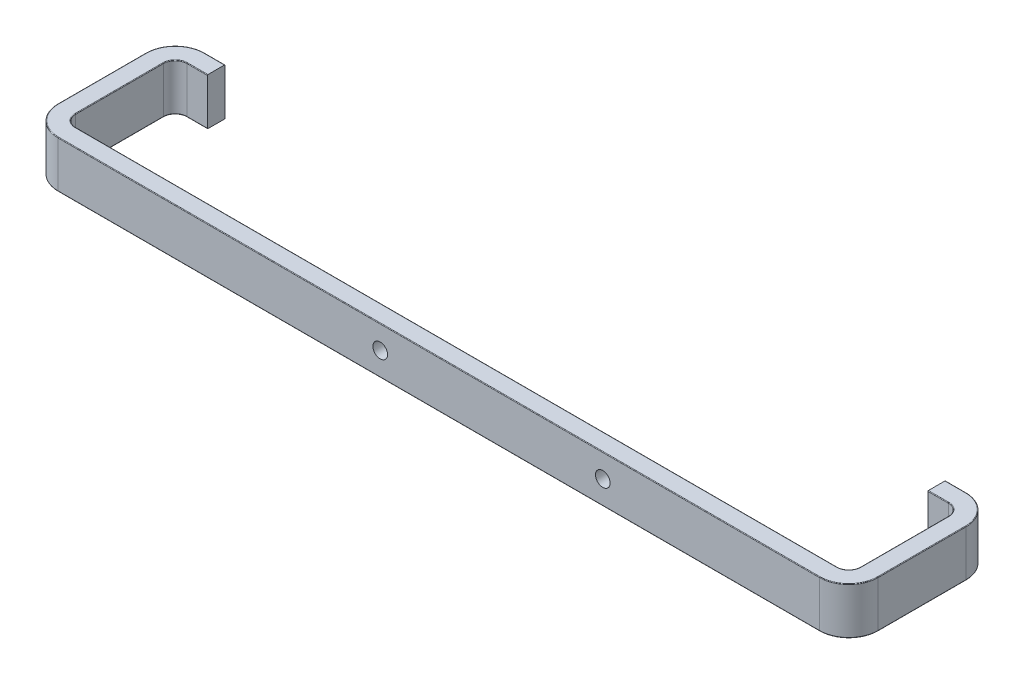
ISO-10303-21;
HEADER;
FILE_DESCRIPTION(('STEP AP214'),'2;1');
FILE_NAME('part.step','',(''),(''),'','','');
FILE_SCHEMA(('AUTOMOTIVE_DESIGN { 1 0 10303 214 1 1 1 1 }'));
ENDSEC;
DATA;
#1=APPLICATION_CONTEXT('core data for automotive mechanical design processes');
#2=APPLICATION_PROTOCOL_DEFINITION('international standard','automotive_design',2000,#1);
#3=PRODUCT_CONTEXT('',#1,'mechanical');
#4=PRODUCT('Part','Part','',(#3));
#5=PRODUCT_RELATED_PRODUCT_CATEGORY('part','',(#4));
#6=PRODUCT_DEFINITION_FORMATION('','',#4);
#7=PRODUCT_DEFINITION_CONTEXT('part definition',#1,'design');
#8=PRODUCT_DEFINITION('design','',#6,#7);
#9=PRODUCT_DEFINITION_SHAPE('','',#8);
#10=(LENGTH_UNIT() NAMED_UNIT(*) SI_UNIT(.MILLI.,.METRE.));
#11=(NAMED_UNIT(*) PLANE_ANGLE_UNIT() SI_UNIT($,.RADIAN.));
#12=(NAMED_UNIT(*) SI_UNIT($,.STERADIAN.) SOLID_ANGLE_UNIT());
#13=UNCERTAINTY_MEASURE_WITH_UNIT(LENGTH_MEASURE(1.E-05),#10,'distance_accuracy_value','');
#14=(GEOMETRIC_REPRESENTATION_CONTEXT(3) GLOBAL_UNCERTAINTY_ASSIGNED_CONTEXT((#13)) GLOBAL_UNIT_ASSIGNED_CONTEXT((#10,
#11,#12)) REPRESENTATION_CONTEXT('',''));
#15=CARTESIAN_POINT('',(0.,0.,0.));
#16=DIRECTION('',(0.,0.,1.));
#17=DIRECTION('',(1.,0.,0.));
#18=AXIS2_PLACEMENT_3D('',#15,#16,#17);
#19=CARTESIAN_POINT('',(-350.,20.,-125.));
#20=DIRECTION('',(0.,0.,-1.));
#21=DIRECTION('',(-1.,0.,0.));
#22=AXIS2_PLACEMENT_3D('',#19,#20,#21);
#23=PLANE('',#22);
#24=DIRECTION('',(0.,1.,0.));
#25=VECTOR('',#24,1.);
#26=CARTESIAN_POINT('',(307.5,-20.,-125.));
#27=LINE('',#26,#25);
#28=CARTESIAN_POINT('',(307.5,-19.5,-125.));
#29=VERTEX_POINT('',#28);
#30=CARTESIAN_POINT('',(307.5,19.5,-125.));
#31=VERTEX_POINT('',#30);
#32=EDGE_CURVE('E312',#29,#31,#27,.T.);
#33=ORIENTED_EDGE('',*,*,#32,.T.);
#34=DIRECTION('',(1.,0.,0.));
#35=VECTOR('',#34,1.);
#36=CARTESIAN_POINT('',(325.,19.5,-125.));
#37=LINE('',#36,#35);
#38=CARTESIAN_POINT('',(325.,19.5,-125.));
#39=VERTEX_POINT('',#38);
#40=EDGE_CURVE('E11',#31,#39,#37,.T.);
#41=ORIENTED_EDGE('',*,*,#40,.T.);
#42=DIRECTION('',(0.,-1.,0.));
#43=VECTOR('',#42,1.);
#44=CARTESIAN_POINT('',(325.,20.,-125.));
#45=LINE('',#44,#43);
#46=CARTESIAN_POINT('',(325.,-19.5,-125.));
#47=VERTEX_POINT('',#46);
#48=EDGE_CURVE('E599',#39,#47,#45,.T.);
#49=ORIENTED_EDGE('',*,*,#48,.T.);
#50=DIRECTION('',(1.,0.,0.));
#51=VECTOR('',#50,1.);
#52=CARTESIAN_POINT('',(-350.,-19.5,-125.));
#53=LINE('',#52,#51);
#54=EDGE_CURVE('E41',#47,#29,#53,.F.);
#55=ORIENTED_EDGE('',*,*,#54,.T.);
#56=EDGE_LOOP('',(#33,#41,#49,#55));
#57=FACE_BOUND('',#56,.T.);
#58=ADVANCED_FACE('F32',(#57),#23,.T.);
#59=CARTESIAN_POINT('',(-350.,20.,0.));
#60=DIRECTION('',(-1.,0.,0.));
#61=DIRECTION('',(0.,0.,1.));
#62=AXIS2_PLACEMENT_3D('',#59,#60,#61);
#63=PLANE('',#62);
#64=DIRECTION('',(0.,-1.,0.));
#65=VECTOR('',#64,1.);
#66=CARTESIAN_POINT('',(-350.,20.,-25.));
#67=LINE('',#66,#65);
#68=CARTESIAN_POINT('',(-350.,-19.5,-25.));
#69=VERTEX_POINT('',#68);
#70=CARTESIAN_POINT('',(-350.,19.5,-25.));
#71=VERTEX_POINT('',#70);
#72=EDGE_CURVE('E621',#69,#71,#67,.F.);
#73=ORIENTED_EDGE('',*,*,#72,.T.);
#74=DIRECTION('',(0.,0.,-1.));
#75=VECTOR('',#74,1.);
#76=CARTESIAN_POINT('',(-350.,19.5,-100.));
#77=LINE('',#76,#75);
#78=CARTESIAN_POINT('',(-350.,19.5,-100.));
#79=VERTEX_POINT('',#78);
#80=EDGE_CURVE('E397',#71,#79,#77,.T.);
#81=ORIENTED_EDGE('',*,*,#80,.T.);
#82=DIRECTION('',(0.,-1.,0.));
#83=VECTOR('',#82,1.);
#84=CARTESIAN_POINT('',(-350.,20.,-100.));
#85=LINE('',#84,#83);
#86=CARTESIAN_POINT('',(-350.,-19.5,-100.));
#87=VERTEX_POINT('',#86);
#88=EDGE_CURVE('E618',#79,#87,#85,.T.);
#89=ORIENTED_EDGE('',*,*,#88,.T.);
#90=DIRECTION('',(0.,0.,-1.));
#91=VECTOR('',#90,1.);
#92=CARTESIAN_POINT('',(-350.,-19.5,0.));
#93=LINE('',#92,#91);
#94=EDGE_CURVE('E395',#87,#69,#93,.F.);
#95=ORIENTED_EDGE('',*,*,#94,.T.);
#96=EDGE_LOOP('',(#73,#81,#89,#95));
#97=FACE_BOUND('',#96,.T.);
#98=ADVANCED_FACE('F752',(#97),#63,.T.);
#99=CARTESIAN_POINT('',(350.,20.,0.));
#100=DIRECTION('',(0.,0.,1.));
#101=DIRECTION('',(1.,0.,0.));
#102=AXIS2_PLACEMENT_3D('',#99,#100,#101);
#103=PLANE('',#102);
#104=CARTESIAN_POINT('',(140.,0.,0.));
#105=DIRECTION('',(0.,0.,1.));
#106=DIRECTION('',(1.,0.,0.));
#107=AXIS2_PLACEMENT_3D('',#104,#105,#106);
#108=CIRCLE('',#107,6.25000000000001);
#109=CARTESIAN_POINT('',(146.25,0.,0.));
#110=VERTEX_POINT('',#109);
#111=EDGE_CURVE('E444',#110,#110,#108,.T.);
#112=ORIENTED_EDGE('',*,*,#111,.F.);
#113=EDGE_LOOP('',(#112));
#114=FACE_BOUND('',#113,.T.);
#115=CARTESIAN_POINT('',(-50.,0.,0.));
#116=DIRECTION('',(0.,0.,1.));
#117=DIRECTION('',(1.,0.,0.));
#118=AXIS2_PLACEMENT_3D('',#115,#116,#117);
#119=CIRCLE('',#118,6.24999999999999);
#120=CARTESIAN_POINT('',(-43.75,0.,0.));
#121=VERTEX_POINT('',#120);
#122=EDGE_CURVE('E783',#121,#121,#119,.T.);
#123=ORIENTED_EDGE('',*,*,#122,.F.);
#124=EDGE_LOOP('',(#123));
#125=FACE_BOUND('',#124,.T.);
#126=DIRECTION('',(0.,-1.,0.));
#127=VECTOR('',#126,1.);
#128=CARTESIAN_POINT('',(325.,20.,0.));
#129=LINE('',#128,#127);
#130=CARTESIAN_POINT('',(325.,-19.5,0.));
#131=VERTEX_POINT('',#130);
#132=CARTESIAN_POINT('',(325.,19.5,0.));
#133=VERTEX_POINT('',#132);
#134=EDGE_CURVE('E615',#131,#133,#129,.F.);
#135=ORIENTED_EDGE('',*,*,#134,.T.);
#136=DIRECTION('',(-1.,0.,0.));
#137=VECTOR('',#136,1.);
#138=CARTESIAN_POINT('',(-325.,19.5,0.));
#139=LINE('',#138,#137);
#140=CARTESIAN_POINT('',(-325.,19.5,0.));
#141=VERTEX_POINT('',#140);
#142=EDGE_CURVE('E405',#133,#141,#139,.T.);
#143=ORIENTED_EDGE('',*,*,#142,.T.);
#144=DIRECTION('',(0.,-1.,0.));
#145=VECTOR('',#144,1.);
#146=CARTESIAN_POINT('',(-325.,20.,0.));
#147=LINE('',#146,#145);
#148=CARTESIAN_POINT('',(-325.,-19.5,0.));
#149=VERTEX_POINT('',#148);
#150=EDGE_CURVE('E607',#141,#149,#147,.T.);
#151=ORIENTED_EDGE('',*,*,#150,.T.);
#152=DIRECTION('',(-1.,0.,0.));
#153=VECTOR('',#152,1.);
#154=CARTESIAN_POINT('',(350.,-19.5,0.));
#155=LINE('',#154,#153);
#156=EDGE_CURVE('E403',#149,#131,#155,.F.);
#157=ORIENTED_EDGE('',*,*,#156,.T.);
#158=EDGE_LOOP('',(#135,#143,#151,#157));
#159=FACE_BOUND('',#158,.T.);
#160=ADVANCED_FACE('F758',(#114,#125,#159),#103,.T.);
#161=CARTESIAN_POINT('',(350.,20.,-125.));
#162=DIRECTION('',(1.,0.,0.));
#163=DIRECTION('',(0.,0.,-1.));
#164=AXIS2_PLACEMENT_3D('',#161,#162,#163);
#165=PLANE('',#164);
#166=DIRECTION('',(0.,-1.,0.));
#167=VECTOR('',#166,1.);
#168=CARTESIAN_POINT('',(350.,20.,-100.));
#169=LINE('',#168,#167);
#170=CARTESIAN_POINT('',(350.,-19.5,-100.));
#171=VERTEX_POINT('',#170);
#172=CARTESIAN_POINT('',(350.,19.5,-100.));
#173=VERTEX_POINT('',#172);
#174=EDGE_CURVE('E597',#171,#173,#169,.F.);
#175=ORIENTED_EDGE('',*,*,#174,.T.);
#176=DIRECTION('',(0.,0.,1.));
#177=VECTOR('',#176,1.);
#178=CARTESIAN_POINT('',(350.,19.5,-25.));
#179=LINE('',#178,#177);
#180=CARTESIAN_POINT('',(350.,19.5,-25.));
#181=VERTEX_POINT('',#180);
#182=EDGE_CURVE('E413',#173,#181,#179,.T.);
#183=ORIENTED_EDGE('',*,*,#182,.T.);
#184=DIRECTION('',(0.,-1.,0.));
#185=VECTOR('',#184,1.);
#186=CARTESIAN_POINT('',(350.,20.,-25.));
#187=LINE('',#186,#185);
#188=CARTESIAN_POINT('',(350.,-19.5,-25.));
#189=VERTEX_POINT('',#188);
#190=EDGE_CURVE('E605',#181,#189,#187,.T.);
#191=ORIENTED_EDGE('',*,*,#190,.T.);
#192=DIRECTION('',(0.,0.,1.));
#193=VECTOR('',#192,1.);
#194=CARTESIAN_POINT('',(350.,-19.5,-125.));
#195=LINE('',#194,#193);
#196=EDGE_CURVE('E411',#189,#171,#195,.F.);
#197=ORIENTED_EDGE('',*,*,#196,.T.);
#198=EDGE_LOOP('',(#175,#183,#191,#197));
#199=FACE_BOUND('',#198,.T.);
#200=ADVANCED_FACE('F601',(#199),#165,.T.);
#201=DIRECTION('',(0.,-1.,0.));
#202=VECTOR('',#201,1.);
#203=CARTESIAN_POINT('',(-325.,20.,-125.));
#204=LINE('',#203,#202);
#205=CARTESIAN_POINT('',(-325.,-19.5,-125.));
#206=VERTEX_POINT('',#205);
#207=CARTESIAN_POINT('',(-325.,19.5,-125.));
#208=VERTEX_POINT('',#207);
#209=EDGE_CURVE('E625',#206,#208,#204,.F.);
#210=ORIENTED_EDGE('',*,*,#209,.T.);
#211=DIRECTION('',(1.,0.,0.));
#212=VECTOR('',#211,1.);
#213=CARTESIAN_POINT('',(-307.5,19.5,-125.));
#214=LINE('',#213,#212);
#215=CARTESIAN_POINT('',(-307.5,19.5,-125.));
#216=VERTEX_POINT('',#215);
#217=EDGE_CURVE('E352',#208,#216,#214,.T.);
#218=ORIENTED_EDGE('',*,*,#217,.T.);
#219=DIRECTION('',(0.,1.,0.));
#220=VECTOR('',#219,1.);
#221=CARTESIAN_POINT('',(-307.5,-20.,-125.));
#222=LINE('',#221,#220);
#223=CARTESIAN_POINT('',(-307.5,-19.5,-125.));
#224=VERTEX_POINT('',#223);
#225=EDGE_CURVE('E556',#224,#216,#222,.T.);
#226=ORIENTED_EDGE('',*,*,#225,.F.);
#227=DIRECTION('',(1.,0.,0.));
#228=VECTOR('',#227,1.);
#229=CARTESIAN_POINT('',(-350.,-19.5,-125.));
#230=LINE('',#229,#228);
#231=EDGE_CURVE('E317',#224,#206,#230,.F.);
#232=ORIENTED_EDGE('',*,*,#231,.T.);
#233=EDGE_LOOP('',(#210,#218,#226,#232));
#234=FACE_BOUND('',#233,.T.);
#235=ADVANCED_FACE('F754',(#234),#23,.T.);
#236=CARTESIAN_POINT('',(0.,20.,0.));
#237=DIRECTION('',(0.,-1.,0.));
#238=DIRECTION('',(0.,0.,-1.));
#239=AXIS2_PLACEMENT_3D('',#236,#237,#238);
#240=PLANE('',#239);
#241=DIRECTION('',(0.,0.,1.));
#242=VECTOR('',#241,1.);
#243=CARTESIAN_POINT('',(-307.5,20.,-125.));
#244=LINE('',#243,#242);
#245=CARTESIAN_POINT('',(-307.5,20.,-124.5));
#246=VERTEX_POINT('',#245);
#247=CARTESIAN_POINT('',(-307.5,20.,-110.5));
#248=VERTEX_POINT('',#247);
#249=EDGE_CURVE('E697',#246,#248,#244,.T.);
#250=ORIENTED_EDGE('',*,*,#249,.F.);
#251=DIRECTION('',(1.,0.,0.));
#252=VECTOR('',#251,1.);
#253=CARTESIAN_POINT('',(-325.,20.,-124.5));
#254=LINE('',#253,#252);
#255=CARTESIAN_POINT('',(-325.,20.,-124.5));
#256=VERTEX_POINT('',#255);
#257=EDGE_CURVE('E389',#246,#256,#254,.F.);
#258=ORIENTED_EDGE('',*,*,#257,.T.);
#259=CARTESIAN_POINT('',(-325.,20.,-100.));
#260=DIRECTION('',(0.,-1.,0.));
#261=DIRECTION('',(0.,0.,-1.));
#262=AXIS2_PLACEMENT_3D('',#259,#260,#261);
#263=CIRCLE('',#262,24.5);
#264=CARTESIAN_POINT('',(-349.5,20.,-100.));
#265=VERTEX_POINT('',#264);
#266=EDGE_CURVE('E387',#256,#265,#263,.F.);
#267=ORIENTED_EDGE('',*,*,#266,.T.);
#268=DIRECTION('',(0.,0.,-1.));
#269=VECTOR('',#268,1.);
#270=CARTESIAN_POINT('',(-349.5,20.,-25.));
#271=LINE('',#270,#269);
#272=CARTESIAN_POINT('',(-349.5,20.,-25.));
#273=VERTEX_POINT('',#272);
#274=EDGE_CURVE('E385',#265,#273,#271,.F.);
#275=ORIENTED_EDGE('',*,*,#274,.T.);
#276=CARTESIAN_POINT('',(-325.,20.,-25.));
#277=DIRECTION('',(0.,-1.,0.));
#278=DIRECTION('',(0.,0.,-1.));
#279=AXIS2_PLACEMENT_3D('',#276,#277,#278);
#280=CIRCLE('',#279,24.5);
#281=CARTESIAN_POINT('',(-325.,20.,-0.5));
#282=VERTEX_POINT('',#281);
#283=EDGE_CURVE('E383',#273,#282,#280,.F.);
#284=ORIENTED_EDGE('',*,*,#283,.T.);
#285=DIRECTION('',(-1.,0.,0.));
#286=VECTOR('',#285,1.);
#287=CARTESIAN_POINT('',(325.,20.,-0.5));
#288=LINE('',#287,#286);
#289=CARTESIAN_POINT('',(325.,20.,-0.499999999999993));
#290=VERTEX_POINT('',#289);
#291=EDGE_CURVE('E381',#282,#290,#288,.F.);
#292=ORIENTED_EDGE('',*,*,#291,.T.);
#293=CARTESIAN_POINT('',(325.,20.,-25.));
#294=DIRECTION('',(0.,-1.,0.));
#295=DIRECTION('',(0.,0.,-1.));
#296=AXIS2_PLACEMENT_3D('',#293,#294,#295);
#297=CIRCLE('',#296,24.5);
#298=CARTESIAN_POINT('',(349.5,20.,-25.));
#299=VERTEX_POINT('',#298);
#300=EDGE_CURVE('E379',#290,#299,#297,.F.);
#301=ORIENTED_EDGE('',*,*,#300,.T.);
#302=DIRECTION('',(0.,0.,1.));
#303=VECTOR('',#302,1.);
#304=CARTESIAN_POINT('',(349.5,20.,-100.));
#305=LINE('',#304,#303);
#306=CARTESIAN_POINT('',(349.5,20.,-100.));
#307=VERTEX_POINT('',#306);
#308=EDGE_CURVE('E377',#299,#307,#305,.F.);
#309=ORIENTED_EDGE('',*,*,#308,.T.);
#310=CARTESIAN_POINT('',(325.,20.,-100.));
#311=DIRECTION('',(0.,-1.,0.));
#312=DIRECTION('',(0.,0.,-1.));
#313=AXIS2_PLACEMENT_3D('',#310,#311,#312);
#314=CIRCLE('',#313,24.5);
#315=CARTESIAN_POINT('',(325.,20.,-124.5));
#316=VERTEX_POINT('',#315);
#317=EDGE_CURVE('E375',#307,#316,#314,.F.);
#318=ORIENTED_EDGE('',*,*,#317,.T.);
#319=DIRECTION('',(1.,0.,0.));
#320=VECTOR('',#319,1.);
#321=CARTESIAN_POINT('',(307.5,20.,-124.5));
#322=LINE('',#321,#320);
#323=CARTESIAN_POINT('',(307.5,20.,-124.5));
#324=VERTEX_POINT('',#323);
#325=EDGE_CURVE('E373',#316,#324,#322,.F.);
#326=ORIENTED_EDGE('',*,*,#325,.T.);
#327=DIRECTION('',(0.,0.,-1.));
#328=VECTOR('',#327,1.);
#329=CARTESIAN_POINT('',(307.5,20.,-110.));
#330=LINE('',#329,#328);
#331=CARTESIAN_POINT('',(307.5,20.,-110.5));
#332=VERTEX_POINT('',#331);
#333=EDGE_CURVE('E582',#332,#324,#330,.T.);
#334=ORIENTED_EDGE('',*,*,#333,.F.);
#335=DIRECTION('',(-1.,0.,0.));
#336=VECTOR('',#335,1.);
#337=CARTESIAN_POINT('',(0.,20.,-110.5));
#338=LINE('',#337,#336);
#339=CARTESIAN_POINT('',(325.,20.,-110.5));
#340=VERTEX_POINT('',#339);
#341=EDGE_CURVE('E355',#332,#340,#338,.F.);
#342=ORIENTED_EDGE('',*,*,#341,.T.);
#343=CARTESIAN_POINT('',(325.,20.,-100.));
#344=DIRECTION('',(0.,-1.,0.));
#345=DIRECTION('',(0.,0.,-1.));
#346=AXIS2_PLACEMENT_3D('',#343,#344,#345);
#347=CIRCLE('',#346,10.5);
#348=CARTESIAN_POINT('',(335.5,20.,-100.));
#349=VERTEX_POINT('',#348);
#350=EDGE_CURVE('E357',#340,#349,#347,.T.);
#351=ORIENTED_EDGE('',*,*,#350,.T.);
#352=DIRECTION('',(0.,0.,-1.));
#353=VECTOR('',#352,1.);
#354=CARTESIAN_POINT('',(335.5,20.,0.));
#355=LINE('',#354,#353);
#356=CARTESIAN_POINT('',(335.5,20.,-25.));
#357=VERTEX_POINT('',#356);
#358=EDGE_CURVE('E359',#349,#357,#355,.F.);
#359=ORIENTED_EDGE('',*,*,#358,.T.);
#360=CARTESIAN_POINT('',(325.,20.,-25.));
#361=DIRECTION('',(0.,-1.,0.));
#362=DIRECTION('',(0.,0.,-1.));
#363=AXIS2_PLACEMENT_3D('',#360,#361,#362);
#364=CIRCLE('',#363,10.5);
#365=CARTESIAN_POINT('',(325.,20.,-14.5));
#366=VERTEX_POINT('',#365);
#367=EDGE_CURVE('E361',#357,#366,#364,.T.);
#368=ORIENTED_EDGE('',*,*,#367,.T.);
#369=DIRECTION('',(1.,0.,0.));
#370=VECTOR('',#369,1.);
#371=CARTESIAN_POINT('',(0.,20.,-14.5));
#372=LINE('',#371,#370);
#373=CARTESIAN_POINT('',(-325.,20.,-14.5));
#374=VERTEX_POINT('',#373);
#375=EDGE_CURVE('E363',#366,#374,#372,.F.);
#376=ORIENTED_EDGE('',*,*,#375,.T.);
#377=CARTESIAN_POINT('',(-325.,20.,-25.));
#378=DIRECTION('',(0.,-1.,0.));
#379=DIRECTION('',(0.,0.,-1.));
#380=AXIS2_PLACEMENT_3D('',#377,#378,#379);
#381=CIRCLE('',#380,10.5);
#382=CARTESIAN_POINT('',(-335.5,20.,-25.));
#383=VERTEX_POINT('',#382);
#384=EDGE_CURVE('E365',#374,#383,#381,.T.);
#385=ORIENTED_EDGE('',*,*,#384,.T.);
#386=DIRECTION('',(0.,0.,1.));
#387=VECTOR('',#386,1.);
#388=CARTESIAN_POINT('',(-335.5,20.,0.));
#389=LINE('',#388,#387);
#390=CARTESIAN_POINT('',(-335.5,20.,-100.));
#391=VERTEX_POINT('',#390);
#392=EDGE_CURVE('E367',#383,#391,#389,.F.);
#393=ORIENTED_EDGE('',*,*,#392,.T.);
#394=CARTESIAN_POINT('',(-325.,20.,-100.));
#395=DIRECTION('',(0.,-1.,0.));
#396=DIRECTION('',(0.,0.,-1.));
#397=AXIS2_PLACEMENT_3D('',#394,#395,#396);
#398=CIRCLE('',#397,10.5);
#399=CARTESIAN_POINT('',(-325.,20.,-110.5));
#400=VERTEX_POINT('',#399);
#401=EDGE_CURVE('E369',#391,#400,#398,.T.);
#402=ORIENTED_EDGE('',*,*,#401,.T.);
#403=DIRECTION('',(-1.,0.,0.));
#404=VECTOR('',#403,1.);
#405=CARTESIAN_POINT('',(0.,20.,-110.5));
#406=LINE('',#405,#404);
#407=EDGE_CURVE('E371',#400,#248,#406,.F.);
#408=ORIENTED_EDGE('',*,*,#407,.T.);
#409=EDGE_LOOP('',(#250,#258,#267,#275,#284,#292,#301,#309,#318,#326,#334,#342,#351,#359,#368,
#376,#385,#393,#402,#408));
#410=FACE_BOUND('',#409,.T.);
#411=ADVANCED_FACE('F733',(#410),#240,.F.);
#412=CARTESIAN_POINT('',(0.,-20.,0.));
#413=DIRECTION('',(0.,-1.,0.));
#414=DIRECTION('',(0.,0.,-1.));
#415=AXIS2_PLACEMENT_3D('',#412,#413,#414);
#416=PLANE('',#415);
#417=CARTESIAN_POINT('',(325.,-20.,-100.));
#418=DIRECTION('',(0.,-1.,0.));
#419=DIRECTION('',(0.,0.,-1.));
#420=AXIS2_PLACEMENT_3D('',#417,#418,#419);
#421=CIRCLE('',#420,10.5);
#422=CARTESIAN_POINT('',(335.5,-20.,-100.));
#423=VERTEX_POINT('',#422);
#424=CARTESIAN_POINT('',(325.,-20.,-110.5));
#425=VERTEX_POINT('',#424);
#426=EDGE_CURVE('E561',#423,#425,#421,.F.);
#427=ORIENTED_EDGE('',*,*,#426,.T.);
#428=DIRECTION('',(-1.,0.,0.));
#429=VECTOR('',#428,1.);
#430=CARTESIAN_POINT('',(307.5,-20.,-110.5));
#431=LINE('',#430,#429);
#432=CARTESIAN_POINT('',(307.5,-20.,-110.5));
#433=VERTEX_POINT('',#432);
#434=EDGE_CURVE('E564',#425,#433,#431,.T.);
#435=ORIENTED_EDGE('',*,*,#434,.T.);
#436=DIRECTION('',(0.,0.,-1.));
#437=VECTOR('',#436,1.);
#438=CARTESIAN_POINT('',(307.5,-20.,-110.));
#439=LINE('',#438,#437);
#440=CARTESIAN_POINT('',(307.5,-20.,-124.5));
#441=VERTEX_POINT('',#440);
#442=EDGE_CURVE('E313',#433,#441,#439,.T.);
#443=ORIENTED_EDGE('',*,*,#442,.T.);
#444=DIRECTION('',(1.,0.,0.));
#445=VECTOR('',#444,1.);
#446=CARTESIAN_POINT('',(0.,-20.,-124.5));
#447=LINE('',#446,#445);
#448=CARTESIAN_POINT('',(325.,-20.,-124.5));
#449=VERTEX_POINT('',#448);
#450=EDGE_CURVE('E640',#441,#449,#447,.T.);
#451=ORIENTED_EDGE('',*,*,#450,.T.);
#452=CARTESIAN_POINT('',(325.,-20.,-100.));
#453=DIRECTION('',(0.,-1.,0.));
#454=DIRECTION('',(0.,0.,-1.));
#455=AXIS2_PLACEMENT_3D('',#452,#453,#454);
#456=CIRCLE('',#455,24.5);
#457=CARTESIAN_POINT('',(349.5,-20.,-100.));
#458=VERTEX_POINT('',#457);
#459=EDGE_CURVE('E638',#449,#458,#456,.T.);
#460=ORIENTED_EDGE('',*,*,#459,.T.);
#461=DIRECTION('',(0.,0.,1.));
#462=VECTOR('',#461,1.);
#463=CARTESIAN_POINT('',(349.5,-20.,0.));
#464=LINE('',#463,#462);
#465=CARTESIAN_POINT('',(349.5,-20.,-25.));
#466=VERTEX_POINT('',#465);
#467=EDGE_CURVE('E636',#458,#466,#464,.T.);
#468=ORIENTED_EDGE('',*,*,#467,.T.);
#469=CARTESIAN_POINT('',(325.,-20.,-25.));
#470=DIRECTION('',(0.,-1.,0.));
#471=DIRECTION('',(0.,0.,-1.));
#472=AXIS2_PLACEMENT_3D('',#469,#470,#471);
#473=CIRCLE('',#472,24.5);
#474=CARTESIAN_POINT('',(325.,-20.,-0.5));
#475=VERTEX_POINT('',#474);
#476=EDGE_CURVE('E634',#466,#475,#473,.T.);
#477=ORIENTED_EDGE('',*,*,#476,.T.);
#478=DIRECTION('',(-1.,0.,0.));
#479=VECTOR('',#478,1.);
#480=CARTESIAN_POINT('',(0.,-20.,-0.5));
#481=LINE('',#480,#479);
#482=CARTESIAN_POINT('',(-325.,-20.,-0.5));
#483=VERTEX_POINT('',#482);
#484=EDGE_CURVE('E632',#475,#483,#481,.T.);
#485=ORIENTED_EDGE('',*,*,#484,.T.);
#486=CARTESIAN_POINT('',(-325.,-20.,-25.));
#487=DIRECTION('',(0.,-1.,0.));
#488=DIRECTION('',(0.,0.,-1.));
#489=AXIS2_PLACEMENT_3D('',#486,#487,#488);
#490=CIRCLE('',#489,24.5);
#491=CARTESIAN_POINT('',(-349.5,-20.,-25.));
#492=VERTEX_POINT('',#491);
#493=EDGE_CURVE('E630',#483,#492,#490,.T.);
#494=ORIENTED_EDGE('',*,*,#493,.T.);
#495=DIRECTION('',(0.,0.,-1.));
#496=VECTOR('',#495,1.);
#497=CARTESIAN_POINT('',(-349.5,-20.,0.));
#498=LINE('',#497,#496);
#499=CARTESIAN_POINT('',(-349.5,-20.,-100.));
#500=VERTEX_POINT('',#499);
#501=EDGE_CURVE('E302',#492,#500,#498,.T.);
#502=ORIENTED_EDGE('',*,*,#501,.T.);
#503=CARTESIAN_POINT('',(-325.,-20.,-100.));
#504=DIRECTION('',(0.,-1.,0.));
#505=DIRECTION('',(0.,0.,-1.));
#506=AXIS2_PLACEMENT_3D('',#503,#504,#505);
#507=CIRCLE('',#506,24.5);
#508=CARTESIAN_POINT('',(-325.,-20.,-124.5));
#509=VERTEX_POINT('',#508);
#510=EDGE_CURVE('E297',#500,#509,#507,.T.);
#511=ORIENTED_EDGE('',*,*,#510,.T.);
#512=DIRECTION('',(1.,0.,0.));
#513=VECTOR('',#512,1.);
#514=CARTESIAN_POINT('',(0.,-20.,-124.5));
#515=LINE('',#514,#513);
#516=CARTESIAN_POINT('',(-307.5,-20.,-124.5));
#517=VERTEX_POINT('',#516);
#518=EDGE_CURVE('E291',#509,#517,#515,.T.);
#519=ORIENTED_EDGE('',*,*,#518,.T.);
#520=DIRECTION('',(0.,0.,1.));
#521=VECTOR('',#520,1.);
#522=CARTESIAN_POINT('',(-307.5,-20.,-125.));
#523=LINE('',#522,#521);
#524=CARTESIAN_POINT('',(-307.5,-20.,-110.5));
#525=VERTEX_POINT('',#524);
#526=EDGE_CURVE('E294',#517,#525,#523,.T.);
#527=ORIENTED_EDGE('',*,*,#526,.T.);
#528=DIRECTION('',(-1.,0.,0.));
#529=VECTOR('',#528,1.);
#530=CARTESIAN_POINT('',(-325.,-20.,-110.5));
#531=LINE('',#530,#529);
#532=CARTESIAN_POINT('',(-325.,-20.,-110.5));
#533=VERTEX_POINT('',#532);
#534=EDGE_CURVE('E559',#525,#533,#531,.T.);
#535=ORIENTED_EDGE('',*,*,#534,.T.);
#536=CARTESIAN_POINT('',(-325.,-20.,-100.));
#537=DIRECTION('',(0.,-1.,0.));
#538=DIRECTION('',(0.,0.,-1.));
#539=AXIS2_PLACEMENT_3D('',#536,#537,#538);
#540=CIRCLE('',#539,10.5);
#541=CARTESIAN_POINT('',(-335.5,-20.,-100.));
#542=VERTEX_POINT('',#541);
#543=EDGE_CURVE('E566',#533,#542,#540,.F.);
#544=ORIENTED_EDGE('',*,*,#543,.T.);
#545=DIRECTION('',(0.,0.,1.));
#546=VECTOR('',#545,1.);
#547=CARTESIAN_POINT('',(-335.5,-20.,-25.));
#548=LINE('',#547,#546);
#549=CARTESIAN_POINT('',(-335.5,-20.,-25.));
#550=VERTEX_POINT('',#549);
#551=EDGE_CURVE('E647',#542,#550,#548,.T.);
#552=ORIENTED_EDGE('',*,*,#551,.T.);
#553=CARTESIAN_POINT('',(-325.,-20.,-25.));
#554=DIRECTION('',(0.,-1.,0.));
#555=DIRECTION('',(0.,0.,-1.));
#556=AXIS2_PLACEMENT_3D('',#553,#554,#555);
#557=CIRCLE('',#556,10.5);
#558=CARTESIAN_POINT('',(-325.,-20.,-14.5));
#559=VERTEX_POINT('',#558);
#560=EDGE_CURVE('E643',#550,#559,#557,.F.);
#561=ORIENTED_EDGE('',*,*,#560,.T.);
#562=DIRECTION('',(1.,0.,0.));
#563=VECTOR('',#562,1.);
#564=CARTESIAN_POINT('',(325.,-20.,-14.5));
#565=LINE('',#564,#563);
#566=CARTESIAN_POINT('',(325.,-20.,-14.5));
#567=VERTEX_POINT('',#566);
#568=EDGE_CURVE('E645',#559,#567,#565,.T.);
#569=ORIENTED_EDGE('',*,*,#568,.T.);
#570=CARTESIAN_POINT('',(325.,-20.,-25.));
#571=DIRECTION('',(0.,-1.,0.));
#572=DIRECTION('',(0.,0.,-1.));
#573=AXIS2_PLACEMENT_3D('',#570,#571,#572);
#574=CIRCLE('',#573,10.5);
#575=CARTESIAN_POINT('',(335.5,-20.,-25.));
#576=VERTEX_POINT('',#575);
#577=EDGE_CURVE('E649',#567,#576,#574,.F.);
#578=ORIENTED_EDGE('',*,*,#577,.T.);
#579=DIRECTION('',(0.,0.,-1.));
#580=VECTOR('',#579,1.);
#581=CARTESIAN_POINT('',(335.5,-20.,-100.));
#582=LINE('',#581,#580);
#583=EDGE_CURVE('E562',#576,#423,#582,.T.);
#584=ORIENTED_EDGE('',*,*,#583,.T.);
#585=EDGE_LOOP('',(#427,#435,#443,#451,#460,#468,#477,#485,#494,#502,#511,#519,#527,#535,#544,
#552,#561,#569,#578,#584));
#586=FACE_BOUND('',#585,.T.);
#587=ADVANCED_FACE('F293',(#586),#416,.T.);
#588=CARTESIAN_POINT('',(307.5,-20.,-110.));
#589=DIRECTION('',(1.,0.,0.));
#590=DIRECTION('',(0.,0.,-1.));
#591=AXIS2_PLACEMENT_3D('',#588,#589,#590);
#592=PLANE('',#591);
#593=ORIENTED_EDGE('',*,*,#442,.F.);
#594=CARTESIAN_POINT('',(307.5,-19.5,-110.5));
#595=DIRECTION('',(1.,0.,0.));
#596=DIRECTION('',(0.,0.,-1.));
#597=AXIS2_PLACEMENT_3D('',#594,#595,#596);
#598=CIRCLE('',#597,0.5);
#599=CARTESIAN_POINT('',(307.5,-19.5,-110.));
#600=VERTEX_POINT('',#599);
#601=EDGE_CURVE('E530',#433,#600,#598,.F.);
#602=ORIENTED_EDGE('',*,*,#601,.T.);
#603=DIRECTION('',(0.,1.,0.));
#604=VECTOR('',#603,1.);
#605=CARTESIAN_POINT('',(307.5,-20.,-110.));
#606=LINE('',#605,#604);
#607=CARTESIAN_POINT('',(307.5,19.5,-110.));
#608=VERTEX_POINT('',#607);
#609=EDGE_CURVE('E555',#600,#608,#606,.T.);
#610=ORIENTED_EDGE('',*,*,#609,.T.);
#611=CARTESIAN_POINT('',(307.5,19.5,-110.5));
#612=DIRECTION('',(1.,0.,0.));
#613=DIRECTION('',(0.,0.,-1.));
#614=AXIS2_PLACEMENT_3D('',#611,#612,#613);
#615=CIRCLE('',#614,0.5);
#616=EDGE_CURVE('E524',#608,#332,#615,.F.);
#617=ORIENTED_EDGE('',*,*,#616,.T.);
#618=ORIENTED_EDGE('',*,*,#333,.T.);
#619=CARTESIAN_POINT('',(307.5,19.5,-124.5));
#620=DIRECTION('',(1.,0.,0.));
#621=DIRECTION('',(0.,0.,-1.));
#622=AXIS2_PLACEMENT_3D('',#619,#620,#621);
#623=CIRCLE('',#622,0.5);
#624=EDGE_CURVE('E533',#324,#31,#623,.F.);
#625=ORIENTED_EDGE('',*,*,#624,.T.);
#626=ORIENTED_EDGE('',*,*,#32,.F.);
#627=CARTESIAN_POINT('',(307.5,-19.5,-124.5));
#628=DIRECTION('',(1.,0.,0.));
#629=DIRECTION('',(0.,0.,-1.));
#630=AXIS2_PLACEMENT_3D('',#627,#628,#629);
#631=CIRCLE('',#630,0.5);
#632=EDGE_CURVE('E573',#29,#441,#631,.F.);
#633=ORIENTED_EDGE('',*,*,#632,.T.);
#634=EDGE_LOOP('',(#593,#602,#610,#617,#618,#625,#626,#633));
#635=FACE_BOUND('',#634,.T.);
#636=ADVANCED_FACE('F579',(#635),#592,.F.);
#637=CARTESIAN_POINT('',(335.,-20.,-110.));
#638=DIRECTION('',(0.,0.,-1.));
#639=DIRECTION('',(-1.,0.,0.));
#640=AXIS2_PLACEMENT_3D('',#637,#638,#639);
#641=PLANE('',#640);
#642=ORIENTED_EDGE('',*,*,#609,.F.);
#643=DIRECTION('',(-1.,0.,0.));
#644=VECTOR('',#643,1.);
#645=CARTESIAN_POINT('',(325.,-19.5,-110.));
#646=LINE('',#645,#644);
#647=CARTESIAN_POINT('',(325.,-19.5,-110.));
#648=VERTEX_POINT('',#647);
#649=EDGE_CURVE('E529',#600,#648,#646,.F.);
#650=ORIENTED_EDGE('',*,*,#649,.T.);
#651=DIRECTION('',(0.,1.,0.));
#652=VECTOR('',#651,1.);
#653=CARTESIAN_POINT('',(325.,20.,-110.));
#654=LINE('',#653,#652);
#655=CARTESIAN_POINT('',(325.,19.5,-110.));
#656=VERTEX_POINT('',#655);
#657=EDGE_CURVE('E709',#648,#656,#654,.T.);
#658=ORIENTED_EDGE('',*,*,#657,.T.);
#659=DIRECTION('',(-1.,0.,0.));
#660=VECTOR('',#659,1.);
#661=CARTESIAN_POINT('',(335.,19.5,-110.));
#662=LINE('',#661,#660);
#663=EDGE_CURVE('E523',#656,#608,#662,.T.);
#664=ORIENTED_EDGE('',*,*,#663,.T.);
#665=EDGE_LOOP('',(#642,#650,#658,#664));
#666=FACE_BOUND('',#665,.T.);
#667=ADVANCED_FACE('F689',(#666),#641,.F.);
#668=CARTESIAN_POINT('',(335.,-20.,-15.));
#669=DIRECTION('',(1.,0.,0.));
#670=DIRECTION('',(0.,0.,-1.));
#671=AXIS2_PLACEMENT_3D('',#668,#669,#670);
#672=PLANE('',#671);
#673=DIRECTION('',(0.,1.,0.));
#674=VECTOR('',#673,1.);
#675=CARTESIAN_POINT('',(335.,-20.,-100.));
#676=LINE('',#675,#674);
#677=CARTESIAN_POINT('',(335.,19.5,-100.));
#678=VERTEX_POINT('',#677);
#679=CARTESIAN_POINT('',(335.,-19.5,-100.));
#680=VERTEX_POINT('',#679);
#681=EDGE_CURVE('E691',#678,#680,#676,.F.);
#682=ORIENTED_EDGE('',*,*,#681,.T.);
#683=DIRECTION('',(0.,0.,-1.));
#684=VECTOR('',#683,1.);
#685=CARTESIAN_POINT('',(335.,-19.5,-25.));
#686=LINE('',#685,#684);
#687=CARTESIAN_POINT('',(335.,-19.5,-25.));
#688=VERTEX_POINT('',#687);
#689=EDGE_CURVE('E329',#680,#688,#686,.F.);
#690=ORIENTED_EDGE('',*,*,#689,.T.);
#691=DIRECTION('',(0.,1.,0.));
#692=VECTOR('',#691,1.);
#693=CARTESIAN_POINT('',(335.,20.,-25.));
#694=LINE('',#693,#692);
#695=CARTESIAN_POINT('',(335.,19.5,-25.));
#696=VERTEX_POINT('',#695);
#697=EDGE_CURVE('E694',#688,#696,#694,.T.);
#698=ORIENTED_EDGE('',*,*,#697,.T.);
#699=DIRECTION('',(0.,0.,-1.));
#700=VECTOR('',#699,1.);
#701=CARTESIAN_POINT('',(335.,19.5,-15.));
#702=LINE('',#701,#700);
#703=EDGE_CURVE('E327',#696,#678,#702,.T.);
#704=ORIENTED_EDGE('',*,*,#703,.T.);
#705=EDGE_LOOP('',(#682,#690,#698,#704));
#706=FACE_BOUND('',#705,.T.);
#707=ADVANCED_FACE('F1180',(#706),#672,.F.);
#708=CARTESIAN_POINT('',(-335.,-20.,-15.));
#709=DIRECTION('',(0.,0.,1.));
#710=DIRECTION('',(1.,0.,0.));
#711=AXIS2_PLACEMENT_3D('',#708,#709,#710);
#712=PLANE('',#711);
#713=CARTESIAN_POINT('',(140.,0.,-15.));
#714=DIRECTION('',(0.,0.,1.));
#715=DIRECTION('',(1.,0.,0.));
#716=AXIS2_PLACEMENT_3D('',#713,#714,#715);
#717=CIRCLE('',#716,6.24999999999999);
#718=CARTESIAN_POINT('',(146.25,0.,-15.));
#719=VERTEX_POINT('',#718);
#720=EDGE_CURVE('E788',#719,#719,#717,.T.);
#721=ORIENTED_EDGE('',*,*,#720,.T.);
#722=EDGE_LOOP('',(#721));
#723=FACE_BOUND('',#722,.T.);
#724=CARTESIAN_POINT('',(-50.,0.,-15.));
#725=DIRECTION('',(0.,0.,1.));
#726=DIRECTION('',(1.,0.,0.));
#727=AXIS2_PLACEMENT_3D('',#724,#725,#726);
#728=CIRCLE('',#727,6.24999999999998);
#729=CARTESIAN_POINT('',(-43.75,0.,-15.));
#730=VERTEX_POINT('',#729);
#731=EDGE_CURVE('E781',#730,#730,#728,.T.);
#732=ORIENTED_EDGE('',*,*,#731,.T.);
#733=EDGE_LOOP('',(#732));
#734=FACE_BOUND('',#733,.T.);
#735=DIRECTION('',(0.,1.,0.));
#736=VECTOR('',#735,1.);
#737=CARTESIAN_POINT('',(325.,-20.,-15.));
#738=LINE('',#737,#736);
#739=CARTESIAN_POINT('',(325.,19.5,-15.));
#740=VERTEX_POINT('',#739);
#741=CARTESIAN_POINT('',(325.,-19.5,-15.));
#742=VERTEX_POINT('',#741);
#743=EDGE_CURVE('E706',#740,#742,#738,.F.);
#744=ORIENTED_EDGE('',*,*,#743,.T.);
#745=DIRECTION('',(1.,0.,0.));
#746=VECTOR('',#745,1.);
#747=CARTESIAN_POINT('',(-325.,-19.5,-15.));
#748=LINE('',#747,#746);
#749=CARTESIAN_POINT('',(-325.,-19.5,-15.));
#750=VERTEX_POINT('',#749);
#751=EDGE_CURVE('E345',#742,#750,#748,.F.);
#752=ORIENTED_EDGE('',*,*,#751,.T.);
#753=DIRECTION('',(0.,1.,0.));
#754=VECTOR('',#753,1.);
#755=CARTESIAN_POINT('',(-325.,20.,-15.));
#756=LINE('',#755,#754);
#757=CARTESIAN_POINT('',(-325.,19.5,-15.));
#758=VERTEX_POINT('',#757);
#759=EDGE_CURVE('E703',#750,#758,#756,.T.);
#760=ORIENTED_EDGE('',*,*,#759,.T.);
#761=DIRECTION('',(1.,0.,0.));
#762=VECTOR('',#761,1.);
#763=CARTESIAN_POINT('',(-335.,19.5,-15.));
#764=LINE('',#763,#762);
#765=EDGE_CURVE('E343',#758,#740,#764,.T.);
#766=ORIENTED_EDGE('',*,*,#765,.T.);
#767=EDGE_LOOP('',(#744,#752,#760,#766));
#768=FACE_BOUND('',#767,.T.);
#769=ADVANCED_FACE('F1171',(#723,#734,#768),#712,.F.);
#770=CARTESIAN_POINT('',(-335.,-20.,-110.));
#771=DIRECTION('',(-1.,0.,0.));
#772=DIRECTION('',(0.,0.,1.));
#773=AXIS2_PLACEMENT_3D('',#770,#771,#772);
#774=PLANE('',#773);
#775=DIRECTION('',(0.,1.,0.));
#776=VECTOR('',#775,1.);
#777=CARTESIAN_POINT('',(-335.,-20.,-25.));
#778=LINE('',#777,#776);
#779=CARTESIAN_POINT('',(-335.,19.5,-25.));
#780=VERTEX_POINT('',#779);
#781=CARTESIAN_POINT('',(-335.,-19.5,-25.));
#782=VERTEX_POINT('',#781);
#783=EDGE_CURVE('E711',#780,#782,#778,.F.);
#784=ORIENTED_EDGE('',*,*,#783,.T.);
#785=DIRECTION('',(0.,0.,1.));
#786=VECTOR('',#785,1.);
#787=CARTESIAN_POINT('',(-335.,-19.5,-100.));
#788=LINE('',#787,#786);
#789=CARTESIAN_POINT('',(-335.,-19.5,-100.));
#790=VERTEX_POINT('',#789);
#791=EDGE_CURVE('E341',#782,#790,#788,.F.);
#792=ORIENTED_EDGE('',*,*,#791,.T.);
#793=DIRECTION('',(0.,1.,0.));
#794=VECTOR('',#793,1.);
#795=CARTESIAN_POINT('',(-335.,20.,-100.));
#796=LINE('',#795,#794);
#797=CARTESIAN_POINT('',(-335.,19.5,-100.));
#798=VERTEX_POINT('',#797);
#799=EDGE_CURVE('E609',#790,#798,#796,.T.);
#800=ORIENTED_EDGE('',*,*,#799,.T.);
#801=DIRECTION('',(0.,0.,1.));
#802=VECTOR('',#801,1.);
#803=CARTESIAN_POINT('',(-335.,19.5,-110.));
#804=LINE('',#803,#802);
#805=EDGE_CURVE('E339',#798,#780,#804,.T.);
#806=ORIENTED_EDGE('',*,*,#805,.T.);
#807=EDGE_LOOP('',(#784,#792,#800,#806));
#808=FACE_BOUND('',#807,.T.);
#809=ADVANCED_FACE('F717',(#808),#774,.F.);
#810=CARTESIAN_POINT('',(-307.5,-20.,-110.));
#811=DIRECTION('',(0.,0.,-1.));
#812=DIRECTION('',(-1.,0.,0.));
#813=AXIS2_PLACEMENT_3D('',#810,#811,#812);
#814=PLANE('',#813);
#815=DIRECTION('',(0.,1.,0.));
#816=VECTOR('',#815,1.);
#817=CARTESIAN_POINT('',(-325.,-20.,-110.));
#818=LINE('',#817,#816);
#819=CARTESIAN_POINT('',(-325.,19.5,-110.));
#820=VERTEX_POINT('',#819);
#821=CARTESIAN_POINT('',(-325.,-19.5,-110.));
#822=VERTEX_POINT('',#821);
#823=EDGE_CURVE('E550',#820,#822,#818,.F.);
#824=ORIENTED_EDGE('',*,*,#823,.T.);
#825=DIRECTION('',(-1.,0.,0.));
#826=VECTOR('',#825,1.);
#827=CARTESIAN_POINT('',(-307.5,-19.5,-110.));
#828=LINE('',#827,#826);
#829=CARTESIAN_POINT('',(-307.5,-19.5,-110.));
#830=VERTEX_POINT('',#829);
#831=EDGE_CURVE('E322',#822,#830,#828,.F.);
#832=ORIENTED_EDGE('',*,*,#831,.T.);
#833=DIRECTION('',(0.,1.,0.));
#834=VECTOR('',#833,1.);
#835=CARTESIAN_POINT('',(-307.5,-20.,-110.));
#836=LINE('',#835,#834);
#837=CARTESIAN_POINT('',(-307.5,19.5,-110.));
#838=VERTEX_POINT('',#837);
#839=EDGE_CURVE('E547',#830,#838,#836,.T.);
#840=ORIENTED_EDGE('',*,*,#839,.T.);
#841=DIRECTION('',(-1.,0.,0.));
#842=VECTOR('',#841,1.);
#843=CARTESIAN_POINT('',(-307.5,19.5,-110.));
#844=LINE('',#843,#842);
#845=EDGE_CURVE('E540',#838,#820,#844,.T.);
#846=ORIENTED_EDGE('',*,*,#845,.T.);
#847=EDGE_LOOP('',(#824,#832,#840,#846));
#848=FACE_BOUND('',#847,.T.);
#849=ADVANCED_FACE('F546',(#848),#814,.F.);
#850=CARTESIAN_POINT('',(-307.5,-20.,-125.));
#851=DIRECTION('',(-1.,0.,0.));
#852=DIRECTION('',(0.,0.,1.));
#853=AXIS2_PLACEMENT_3D('',#850,#851,#852);
#854=PLANE('',#853);
#855=ORIENTED_EDGE('',*,*,#839,.F.);
#856=CARTESIAN_POINT('',(-307.5,-19.5,-110.5));
#857=DIRECTION('',(-1.,0.,0.));
#858=DIRECTION('',(0.,0.,1.));
#859=AXIS2_PLACEMENT_3D('',#856,#857,#858);
#860=CIRCLE('',#859,0.5);
#861=EDGE_CURVE('E311',#830,#525,#860,.F.);
#862=ORIENTED_EDGE('',*,*,#861,.T.);
#863=ORIENTED_EDGE('',*,*,#526,.F.);
#864=CARTESIAN_POINT('',(-307.5,-19.5,-124.5));
#865=DIRECTION('',(-1.,0.,0.));
#866=DIRECTION('',(0.,0.,1.));
#867=AXIS2_PLACEMENT_3D('',#864,#865,#866);
#868=CIRCLE('',#867,0.5);
#869=EDGE_CURVE('E308',#517,#224,#868,.F.);
#870=ORIENTED_EDGE('',*,*,#869,.T.);
#871=ORIENTED_EDGE('',*,*,#225,.T.);
#872=CARTESIAN_POINT('',(-307.5,19.5,-124.5));
#873=DIRECTION('',(-1.,0.,0.));
#874=DIRECTION('',(0.,0.,1.));
#875=AXIS2_PLACEMENT_3D('',#872,#873,#874);
#876=CIRCLE('',#875,0.5);
#877=EDGE_CURVE('E318',#216,#246,#876,.F.);
#878=ORIENTED_EDGE('',*,*,#877,.T.);
#879=ORIENTED_EDGE('',*,*,#249,.T.);
#880=CARTESIAN_POINT('',(-307.5,19.5,-110.5));
#881=DIRECTION('',(-1.,0.,0.));
#882=DIRECTION('',(0.,0.,1.));
#883=AXIS2_PLACEMENT_3D('',#880,#881,#882);
#884=CIRCLE('',#883,0.5);
#885=EDGE_CURVE('E319',#248,#838,#884,.F.);
#886=ORIENTED_EDGE('',*,*,#885,.T.);
#887=EDGE_LOOP('',(#855,#862,#863,#870,#871,#878,#879,#886));
#888=FACE_BOUND('',#887,.T.);
#889=ADVANCED_FACE('F306',(#888),#854,.F.);
#890=CARTESIAN_POINT('',(-50.,0.,0.));
#891=DIRECTION('',(0.,0.,1.));
#892=DIRECTION('',(1.,0.,0.));
#893=AXIS2_PLACEMENT_3D('',#890,#891,#892);
#894=CYLINDRICAL_SURFACE('',#893,6.24999999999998);
#895=ORIENTED_EDGE('',*,*,#122,.T.);
#896=EDGE_LOOP('',(#895));
#897=FACE_BOUND('',#896,.T.);
#898=ORIENTED_EDGE('',*,*,#731,.F.);
#899=EDGE_LOOP('',(#898));
#900=FACE_BOUND('',#899,.T.);
#901=ADVANCED_FACE('F1152',(#897,#900),#894,.F.);
#902=CARTESIAN_POINT('',(140.,0.,0.));
#903=DIRECTION('',(0.,0.,1.));
#904=DIRECTION('',(1.,0.,0.));
#905=AXIS2_PLACEMENT_3D('',#902,#903,#904);
#906=CYLINDRICAL_SURFACE('',#905,6.24999999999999);
#907=ORIENTED_EDGE('',*,*,#111,.T.);
#908=EDGE_LOOP('',(#907));
#909=FACE_BOUND('',#908,.T.);
#910=ORIENTED_EDGE('',*,*,#720,.F.);
#911=EDGE_LOOP('',(#910));
#912=FACE_BOUND('',#911,.T.);
#913=ADVANCED_FACE('F794',(#909,#912),#906,.F.);
#914=CARTESIAN_POINT('',(325.,-20.,-25.));
#915=DIRECTION('',(0.,-1.,0.));
#916=DIRECTION('',(0.,0.,-1.));
#917=AXIS2_PLACEMENT_3D('',#914,#915,#916);
#918=CYLINDRICAL_SURFACE('',#917,10.);
#919=ORIENTED_EDGE('',*,*,#697,.F.);
#920=CARTESIAN_POINT('',(325.,-19.5,-25.));
#921=DIRECTION('',(0.,-1.,0.));
#922=DIRECTION('',(0.,0.,-1.));
#923=AXIS2_PLACEMENT_3D('',#920,#921,#922);
#924=CIRCLE('',#923,10.);
#925=EDGE_CURVE('E337',#688,#742,#924,.T.);
#926=ORIENTED_EDGE('',*,*,#925,.T.);
#927=ORIENTED_EDGE('',*,*,#743,.F.);
#928=CARTESIAN_POINT('',(325.,19.5,-25.));
#929=DIRECTION('',(0.,-1.,0.));
#930=DIRECTION('',(0.,0.,-1.));
#931=AXIS2_PLACEMENT_3D('',#928,#929,#930);
#932=CIRCLE('',#931,10.);
#933=EDGE_CURVE('E335',#740,#696,#932,.F.);
#934=ORIENTED_EDGE('',*,*,#933,.T.);
#935=EDGE_LOOP('',(#919,#926,#927,#934));
#936=FACE_BOUND('',#935,.T.);
#937=ADVANCED_FACE('F748',(#936),#918,.F.);
#938=CARTESIAN_POINT('',(325.,-20.,-100.));
#939=DIRECTION('',(0.,-1.,0.));
#940=DIRECTION('',(0.,0.,-1.));
#941=AXIS2_PLACEMENT_3D('',#938,#939,#940);
#942=CYLINDRICAL_SURFACE('',#941,10.);
#943=ORIENTED_EDGE('',*,*,#657,.F.);
#944=CARTESIAN_POINT('',(325.,-19.5,-100.));
#945=DIRECTION('',(0.,-1.,0.));
#946=DIRECTION('',(0.,0.,-1.));
#947=AXIS2_PLACEMENT_3D('',#944,#945,#946);
#948=CIRCLE('',#947,10.);
#949=EDGE_CURVE('E538',#648,#680,#948,.T.);
#950=ORIENTED_EDGE('',*,*,#949,.T.);
#951=ORIENTED_EDGE('',*,*,#681,.F.);
#952=CARTESIAN_POINT('',(325.,19.5,-100.));
#953=DIRECTION('',(0.,-1.,0.));
#954=DIRECTION('',(0.,0.,-1.));
#955=AXIS2_PLACEMENT_3D('',#952,#953,#954);
#956=CIRCLE('',#955,10.);
#957=EDGE_CURVE('E518',#678,#656,#956,.F.);
#958=ORIENTED_EDGE('',*,*,#957,.T.);
#959=EDGE_LOOP('',(#943,#950,#951,#958));
#960=FACE_BOUND('',#959,.T.);
#961=ADVANCED_FACE('F739',(#960),#942,.F.);
#962=CARTESIAN_POINT('',(-325.,-20.,-100.));
#963=DIRECTION('',(0.,-1.,0.));
#964=DIRECTION('',(0.,0.,-1.));
#965=AXIS2_PLACEMENT_3D('',#962,#963,#964);
#966=CYLINDRICAL_SURFACE('',#965,10.);
#967=ORIENTED_EDGE('',*,*,#799,.F.);
#968=CARTESIAN_POINT('',(-325.,-19.5,-100.));
#969=DIRECTION('',(0.,-1.,0.));
#970=DIRECTION('',(0.,0.,-1.));
#971=AXIS2_PLACEMENT_3D('',#968,#969,#970);
#972=CIRCLE('',#971,10.);
#973=EDGE_CURVE('E333',#790,#822,#972,.T.);
#974=ORIENTED_EDGE('',*,*,#973,.T.);
#975=ORIENTED_EDGE('',*,*,#823,.F.);
#976=CARTESIAN_POINT('',(-325.,19.5,-100.));
#977=DIRECTION('',(0.,-1.,0.));
#978=DIRECTION('',(0.,0.,-1.));
#979=AXIS2_PLACEMENT_3D('',#976,#977,#978);
#980=CIRCLE('',#979,10.);
#981=EDGE_CURVE('E331',#820,#798,#980,.F.);
#982=ORIENTED_EDGE('',*,*,#981,.T.);
#983=EDGE_LOOP('',(#967,#974,#975,#982));
#984=FACE_BOUND('',#983,.T.);
#985=ADVANCED_FACE('F736',(#984),#966,.F.);
#986=CARTESIAN_POINT('',(-325.,-20.,-25.));
#987=DIRECTION('',(0.,-1.,0.));
#988=DIRECTION('',(0.,0.,-1.));
#989=AXIS2_PLACEMENT_3D('',#986,#987,#988);
#990=CYLINDRICAL_SURFACE('',#989,10.);
#991=ORIENTED_EDGE('',*,*,#759,.F.);
#992=CARTESIAN_POINT('',(-325.,-19.5,-25.));
#993=DIRECTION('',(0.,-1.,0.));
#994=DIRECTION('',(0.,0.,-1.));
#995=AXIS2_PLACEMENT_3D('',#992,#993,#994);
#996=CIRCLE('',#995,10.);
#997=EDGE_CURVE('E349',#750,#782,#996,.T.);
#998=ORIENTED_EDGE('',*,*,#997,.T.);
#999=ORIENTED_EDGE('',*,*,#783,.F.);
#1000=CARTESIAN_POINT('',(-325.,19.5,-25.));
#1001=DIRECTION('',(0.,-1.,0.));
#1002=DIRECTION('',(0.,0.,-1.));
#1003=AXIS2_PLACEMENT_3D('',#1000,#1001,#1002);
#1004=CIRCLE('',#1003,10.);
#1005=EDGE_CURVE('E347',#780,#758,#1004,.F.);
#1006=ORIENTED_EDGE('',*,*,#1005,.T.);
#1007=EDGE_LOOP('',(#991,#998,#999,#1006));
#1008=FACE_BOUND('',#1007,.T.);
#1009=ADVANCED_FACE('F738',(#1008),#990,.F.);
#1010=CARTESIAN_POINT('',(325.,20.,-25.));
#1011=DIRECTION('',(0.,-1.,0.));
#1012=DIRECTION('',(0.,0.,-1.));
#1013=AXIS2_PLACEMENT_3D('',#1010,#1011,#1012);
#1014=CYLINDRICAL_SURFACE('',#1013,25.);
#1015=ORIENTED_EDGE('',*,*,#190,.F.);
#1016=CARTESIAN_POINT('',(325.,19.5,-25.));
#1017=DIRECTION('',(0.,-1.,0.));
#1018=DIRECTION('',(0.,0.,-1.));
#1019=AXIS2_PLACEMENT_3D('',#1016,#1017,#1018);
#1020=CIRCLE('',#1019,25.);
#1021=EDGE_CURVE('E409',#181,#133,#1020,.T.);
#1022=ORIENTED_EDGE('',*,*,#1021,.T.);
#1023=ORIENTED_EDGE('',*,*,#134,.F.);
#1024=CARTESIAN_POINT('',(325.,-19.5,-25.));
#1025=DIRECTION('',(0.,-1.,0.));
#1026=DIRECTION('',(0.,0.,-1.));
#1027=AXIS2_PLACEMENT_3D('',#1024,#1025,#1026);
#1028=CIRCLE('',#1027,25.);
#1029=EDGE_CURVE('E407',#131,#189,#1028,.F.);
#1030=ORIENTED_EDGE('',*,*,#1029,.T.);
#1031=EDGE_LOOP('',(#1015,#1022,#1023,#1030));
#1032=FACE_BOUND('',#1031,.T.);
#1033=ADVANCED_FACE('F745',(#1032),#1014,.T.);
#1034=CARTESIAN_POINT('',(-325.,20.,-25.));
#1035=DIRECTION('',(0.,-1.,0.));
#1036=DIRECTION('',(0.,0.,-1.));
#1037=AXIS2_PLACEMENT_3D('',#1034,#1035,#1036);
#1038=CYLINDRICAL_SURFACE('',#1037,25.);
#1039=ORIENTED_EDGE('',*,*,#150,.F.);
#1040=CARTESIAN_POINT('',(-325.,19.5,-25.));
#1041=DIRECTION('',(0.,-1.,0.));
#1042=DIRECTION('',(0.,0.,-1.));
#1043=AXIS2_PLACEMENT_3D('',#1040,#1041,#1042);
#1044=CIRCLE('',#1043,25.);
#1045=EDGE_CURVE('E401',#141,#71,#1044,.T.);
#1046=ORIENTED_EDGE('',*,*,#1045,.T.);
#1047=ORIENTED_EDGE('',*,*,#72,.F.);
#1048=CARTESIAN_POINT('',(-325.,-19.5,-25.));
#1049=DIRECTION('',(0.,-1.,0.));
#1050=DIRECTION('',(0.,0.,-1.));
#1051=AXIS2_PLACEMENT_3D('',#1048,#1049,#1050);
#1052=CIRCLE('',#1051,25.);
#1053=EDGE_CURVE('E399',#69,#149,#1052,.F.);
#1054=ORIENTED_EDGE('',*,*,#1053,.T.);
#1055=EDGE_LOOP('',(#1039,#1046,#1047,#1054));
#1056=FACE_BOUND('',#1055,.T.);
#1057=ADVANCED_FACE('F825',(#1056),#1038,.T.);
#1058=CARTESIAN_POINT('',(325.,20.,-100.));
#1059=DIRECTION('',(0.,-1.,0.));
#1060=DIRECTION('',(0.,0.,-1.));
#1061=AXIS2_PLACEMENT_3D('',#1058,#1059,#1060);
#1062=CYLINDRICAL_SURFACE('',#1061,25.);
#1063=ORIENTED_EDGE('',*,*,#48,.F.);
#1064=CARTESIAN_POINT('',(325.,19.5,-100.));
#1065=DIRECTION('',(0.,-1.,0.));
#1066=DIRECTION('',(0.,0.,-1.));
#1067=AXIS2_PLACEMENT_3D('',#1064,#1065,#1066);
#1068=CIRCLE('',#1067,25.);
#1069=EDGE_CURVE('E416',#39,#173,#1068,.T.);
#1070=ORIENTED_EDGE('',*,*,#1069,.T.);
#1071=ORIENTED_EDGE('',*,*,#174,.F.);
#1072=CARTESIAN_POINT('',(325.,-19.5,-100.));
#1073=DIRECTION('',(0.,-1.,0.));
#1074=DIRECTION('',(0.,0.,-1.));
#1075=AXIS2_PLACEMENT_3D('',#1072,#1073,#1074);
#1076=CIRCLE('',#1075,25.);
#1077=EDGE_CURVE('E49',#171,#47,#1076,.F.);
#1078=ORIENTED_EDGE('',*,*,#1077,.T.);
#1079=EDGE_LOOP('',(#1063,#1070,#1071,#1078));
#1080=FACE_BOUND('',#1079,.T.);
#1081=ADVANCED_FACE('F596',(#1080),#1062,.T.);
#1082=CARTESIAN_POINT('',(-325.,20.,-100.));
#1083=DIRECTION('',(0.,-1.,0.));
#1084=DIRECTION('',(0.,0.,-1.));
#1085=AXIS2_PLACEMENT_3D('',#1082,#1083,#1084);
#1086=CYLINDRICAL_SURFACE('',#1085,25.);
#1087=ORIENTED_EDGE('',*,*,#88,.F.);
#1088=CARTESIAN_POINT('',(-325.,19.5,-100.));
#1089=DIRECTION('',(0.,-1.,0.));
#1090=DIRECTION('',(0.,0.,-1.));
#1091=AXIS2_PLACEMENT_3D('',#1088,#1089,#1090);
#1092=CIRCLE('',#1091,25.);
#1093=EDGE_CURVE('E393',#79,#208,#1092,.T.);
#1094=ORIENTED_EDGE('',*,*,#1093,.T.);
#1095=ORIENTED_EDGE('',*,*,#209,.F.);
#1096=CARTESIAN_POINT('',(-325.,-19.5,-100.));
#1097=DIRECTION('',(0.,-1.,0.));
#1098=DIRECTION('',(0.,0.,-1.));
#1099=AXIS2_PLACEMENT_3D('',#1096,#1097,#1098);
#1100=CIRCLE('',#1099,25.);
#1101=EDGE_CURVE('E391',#206,#87,#1100,.F.);
#1102=ORIENTED_EDGE('',*,*,#1101,.T.);
#1103=EDGE_LOOP('',(#1087,#1094,#1095,#1102));
#1104=FACE_BOUND('',#1103,.T.);
#1105=ADVANCED_FACE('F1084',(#1104),#1086,.T.);
#1106=CARTESIAN_POINT('',(0.,-19.5,-110.5));
#1107=DIRECTION('',(1.,0.,0.));
#1108=DIRECTION('',(0.,0.,-1.));
#1109=AXIS2_PLACEMENT_3D('',#1106,#1107,#1108);
#1110=CYLINDRICAL_SURFACE('',#1109,0.5);
#1111=ORIENTED_EDGE('',*,*,#861,.F.);
#1112=ORIENTED_EDGE('',*,*,#831,.F.);
#1113=CARTESIAN_POINT('',(-325.,-19.5,-110.5));
#1114=DIRECTION('',(-1.,0.,0.));
#1115=DIRECTION('',(0.,0.,1.));
#1116=AXIS2_PLACEMENT_3D('',#1113,#1114,#1115);
#1117=CIRCLE('',#1116,0.5);
#1118=EDGE_CURVE('E441',#533,#822,#1117,.T.);
#1119=ORIENTED_EDGE('',*,*,#1118,.F.);
#1120=ORIENTED_EDGE('',*,*,#534,.F.);
#1121=EDGE_LOOP('',(#1111,#1112,#1119,#1120));
#1122=FACE_BOUND('',#1121,.T.);
#1123=ADVANCED_FACE('F558',(#1122),#1110,.T.);
#1124=CARTESIAN_POINT('',(-325.,-19.5,-100.));
#1125=DIRECTION('',(0.,-1.,0.));
#1126=DIRECTION('',(0.,0.,-1.));
#1127=AXIS2_PLACEMENT_3D('',#1124,#1125,#1126);
#1128=TOROIDAL_SURFACE('',#1127,10.5,0.5);
#1129=ORIENTED_EDGE('',*,*,#1118,.T.);
#1130=ORIENTED_EDGE('',*,*,#973,.F.);
#1131=CARTESIAN_POINT('',(-335.5,-19.5,-100.));
#1132=DIRECTION('',(0.,0.,1.));
#1133=DIRECTION('',(1.,0.,0.));
#1134=AXIS2_PLACEMENT_3D('',#1131,#1132,#1133);
#1135=CIRCLE('',#1134,0.5);
#1136=EDGE_CURVE('E438',#542,#790,#1135,.T.);
#1137=ORIENTED_EDGE('',*,*,#1136,.F.);
#1138=ORIENTED_EDGE('',*,*,#543,.F.);
#1139=EDGE_LOOP('',(#1129,#1130,#1137,#1138));
#1140=FACE_BOUND('',#1139,.T.);
#1141=ADVANCED_FACE('F655',(#1140),#1128,.T.);
#1142=CARTESIAN_POINT('',(-335.5,-19.5,0.));
#1143=DIRECTION('',(0.,0.,-1.));
#1144=DIRECTION('',(-1.,0.,0.));
#1145=AXIS2_PLACEMENT_3D('',#1142,#1143,#1144);
#1146=CYLINDRICAL_SURFACE('',#1145,0.5);
#1147=ORIENTED_EDGE('',*,*,#1136,.T.);
#1148=ORIENTED_EDGE('',*,*,#791,.F.);
#1149=CARTESIAN_POINT('',(-335.5,-19.5,-25.));
#1150=DIRECTION('',(0.,0.,1.));
#1151=DIRECTION('',(1.,0.,0.));
#1152=AXIS2_PLACEMENT_3D('',#1149,#1150,#1151);
#1153=CIRCLE('',#1152,0.5);
#1154=EDGE_CURVE('E435',#550,#782,#1153,.T.);
#1155=ORIENTED_EDGE('',*,*,#1154,.F.);
#1156=ORIENTED_EDGE('',*,*,#551,.F.);
#1157=EDGE_LOOP('',(#1147,#1148,#1155,#1156));
#1158=FACE_BOUND('',#1157,.T.);
#1159=ADVANCED_FACE('F658',(#1158),#1146,.T.);
#1160=CARTESIAN_POINT('',(-325.,-19.5,-25.));
#1161=DIRECTION('',(0.,-1.,0.));
#1162=DIRECTION('',(0.,0.,-1.));
#1163=AXIS2_PLACEMENT_3D('',#1160,#1161,#1162);
#1164=TOROIDAL_SURFACE('',#1163,10.5,0.5);
#1165=ORIENTED_EDGE('',*,*,#1154,.T.);
#1166=ORIENTED_EDGE('',*,*,#997,.F.);
#1167=CARTESIAN_POINT('',(-325.,-19.5,-14.5));
#1168=DIRECTION('',(1.,0.,0.));
#1169=DIRECTION('',(0.,0.,-1.));
#1170=AXIS2_PLACEMENT_3D('',#1167,#1168,#1169);
#1171=CIRCLE('',#1170,0.5);
#1172=EDGE_CURVE('E432',#559,#750,#1171,.T.);
#1173=ORIENTED_EDGE('',*,*,#1172,.F.);
#1174=ORIENTED_EDGE('',*,*,#560,.F.);
#1175=EDGE_LOOP('',(#1165,#1166,#1173,#1174));
#1176=FACE_BOUND('',#1175,.T.);
#1177=ADVANCED_FACE('F663',(#1176),#1164,.T.);
#1178=CARTESIAN_POINT('',(0.,-19.5,-14.5));
#1179=DIRECTION('',(-1.,0.,0.));
#1180=DIRECTION('',(0.,0.,1.));
#1181=AXIS2_PLACEMENT_3D('',#1178,#1179,#1180);
#1182=CYLINDRICAL_SURFACE('',#1181,0.5);
#1183=ORIENTED_EDGE('',*,*,#1172,.T.);
#1184=ORIENTED_EDGE('',*,*,#751,.F.);
#1185=CARTESIAN_POINT('',(325.,-19.5,-14.5));
#1186=DIRECTION('',(1.,0.,0.));
#1187=DIRECTION('',(0.,0.,-1.));
#1188=AXIS2_PLACEMENT_3D('',#1185,#1186,#1187);
#1189=CIRCLE('',#1188,0.5);
#1190=EDGE_CURVE('E429',#567,#742,#1189,.T.);
#1191=ORIENTED_EDGE('',*,*,#1190,.F.);
#1192=ORIENTED_EDGE('',*,*,#568,.F.);
#1193=EDGE_LOOP('',(#1183,#1184,#1191,#1192));
#1194=FACE_BOUND('',#1193,.T.);
#1195=ADVANCED_FACE('F670',(#1194),#1182,.T.);
#1196=CARTESIAN_POINT('',(325.,-19.5,-25.));
#1197=DIRECTION('',(0.,-1.,0.));
#1198=DIRECTION('',(0.,0.,-1.));
#1199=AXIS2_PLACEMENT_3D('',#1196,#1197,#1198);
#1200=TOROIDAL_SURFACE('',#1199,10.5,0.5);
#1201=ORIENTED_EDGE('',*,*,#1190,.T.);
#1202=ORIENTED_EDGE('',*,*,#925,.F.);
#1203=CARTESIAN_POINT('',(335.5,-19.5,-25.));
#1204=DIRECTION('',(0.,0.,-1.));
#1205=DIRECTION('',(-1.,0.,0.));
#1206=AXIS2_PLACEMENT_3D('',#1203,#1204,#1205);
#1207=CIRCLE('',#1206,0.5);
#1208=EDGE_CURVE('E426',#576,#688,#1207,.T.);
#1209=ORIENTED_EDGE('',*,*,#1208,.F.);
#1210=ORIENTED_EDGE('',*,*,#577,.F.);
#1211=EDGE_LOOP('',(#1201,#1202,#1209,#1210));
#1212=FACE_BOUND('',#1211,.T.);
#1213=ADVANCED_FACE('F673',(#1212),#1200,.T.);
#1214=CARTESIAN_POINT('',(335.5,-19.5,0.));
#1215=DIRECTION('',(0.,0.,1.));
#1216=DIRECTION('',(1.,0.,0.));
#1217=AXIS2_PLACEMENT_3D('',#1214,#1215,#1216);
#1218=CYLINDRICAL_SURFACE('',#1217,0.5);
#1219=ORIENTED_EDGE('',*,*,#1208,.T.);
#1220=ORIENTED_EDGE('',*,*,#689,.F.);
#1221=CARTESIAN_POINT('',(335.5,-19.5,-100.));
#1222=DIRECTION('',(0.,0.,-1.));
#1223=DIRECTION('',(-1.,0.,0.));
#1224=AXIS2_PLACEMENT_3D('',#1221,#1222,#1223);
#1225=CIRCLE('',#1224,0.5);
#1226=EDGE_CURVE('E422',#423,#680,#1225,.T.);
#1227=ORIENTED_EDGE('',*,*,#1226,.F.);
#1228=ORIENTED_EDGE('',*,*,#583,.F.);
#1229=EDGE_LOOP('',(#1219,#1220,#1227,#1228));
#1230=FACE_BOUND('',#1229,.T.);
#1231=ADVANCED_FACE('F678',(#1230),#1218,.T.);
#1232=CARTESIAN_POINT('',(325.,-19.5,-100.));
#1233=DIRECTION('',(0.,-1.,0.));
#1234=DIRECTION('',(0.,0.,-1.));
#1235=AXIS2_PLACEMENT_3D('',#1232,#1233,#1234);
#1236=TOROIDAL_SURFACE('',#1235,10.5,0.5);
#1237=ORIENTED_EDGE('',*,*,#1226,.T.);
#1238=ORIENTED_EDGE('',*,*,#949,.F.);
#1239=CARTESIAN_POINT('',(325.,-19.5,-110.5));
#1240=DIRECTION('',(-1.,0.,0.));
#1241=DIRECTION('',(0.,0.,1.));
#1242=AXIS2_PLACEMENT_3D('',#1239,#1240,#1241);
#1243=CIRCLE('',#1242,0.5);
#1244=EDGE_CURVE('E419',#425,#648,#1243,.T.);
#1245=ORIENTED_EDGE('',*,*,#1244,.F.);
#1246=ORIENTED_EDGE('',*,*,#426,.F.);
#1247=EDGE_LOOP('',(#1237,#1238,#1245,#1246));
#1248=FACE_BOUND('',#1247,.T.);
#1249=ADVANCED_FACE('F685',(#1248),#1236,.T.);
#1250=CARTESIAN_POINT('',(0.,-19.5,-110.5));
#1251=DIRECTION('',(1.,0.,0.));
#1252=DIRECTION('',(0.,0.,-1.));
#1253=AXIS2_PLACEMENT_3D('',#1250,#1251,#1252);
#1254=CYLINDRICAL_SURFACE('',#1253,0.5);
#1255=ORIENTED_EDGE('',*,*,#1244,.T.);
#1256=ORIENTED_EDGE('',*,*,#649,.F.);
#1257=ORIENTED_EDGE('',*,*,#601,.F.);
#1258=ORIENTED_EDGE('',*,*,#434,.F.);
#1259=EDGE_LOOP('',(#1255,#1256,#1257,#1258));
#1260=FACE_BOUND('',#1259,.T.);
#1261=ADVANCED_FACE('F688',(#1260),#1254,.T.);
#1262=CARTESIAN_POINT('',(-350.,19.5,-124.5));
#1263=DIRECTION('',(-1.,0.,0.));
#1264=DIRECTION('',(0.,0.,1.));
#1265=AXIS2_PLACEMENT_3D('',#1262,#1263,#1264);
#1266=CYLINDRICAL_SURFACE('',#1265,0.5);
#1267=ORIENTED_EDGE('',*,*,#624,.F.);
#1268=ORIENTED_EDGE('',*,*,#325,.F.);
#1269=CARTESIAN_POINT('',(325.,19.5,-124.5));
#1270=DIRECTION('',(1.,0.,0.));
#1271=DIRECTION('',(0.,0.,-1.));
#1272=AXIS2_PLACEMENT_3D('',#1269,#1270,#1271);
#1273=CIRCLE('',#1272,0.5);
#1274=EDGE_CURVE('E423',#39,#316,#1273,.T.);
#1275=ORIENTED_EDGE('',*,*,#1274,.F.);
#1276=ORIENTED_EDGE('',*,*,#40,.F.);
#1277=EDGE_LOOP('',(#1267,#1268,#1275,#1276));
#1278=FACE_BOUND('',#1277,.T.);
#1279=ADVANCED_FACE('F588',(#1278),#1266,.T.);
#1280=CARTESIAN_POINT('',(325.,19.5,-100.));
#1281=DIRECTION('',(0.,-1.,0.));
#1282=DIRECTION('',(0.,0.,-1.));
#1283=AXIS2_PLACEMENT_3D('',#1280,#1281,#1282);
#1284=TOROIDAL_SURFACE('',#1283,24.5,0.5);
#1285=ORIENTED_EDGE('',*,*,#1274,.T.);
#1286=ORIENTED_EDGE('',*,*,#317,.F.);
#1287=CARTESIAN_POINT('',(349.5,19.5,-100.));
#1288=DIRECTION('',(0.,0.,1.));
#1289=DIRECTION('',(1.,0.,0.));
#1290=AXIS2_PLACEMENT_3D('',#1287,#1288,#1289);
#1291=CIRCLE('',#1290,0.5);
#1292=EDGE_CURVE('E464',#173,#307,#1291,.T.);
#1293=ORIENTED_EDGE('',*,*,#1292,.F.);
#1294=ORIENTED_EDGE('',*,*,#1069,.F.);
#1295=EDGE_LOOP('',(#1285,#1286,#1293,#1294));
#1296=FACE_BOUND('',#1295,.T.);
#1297=ADVANCED_FACE('F593',(#1296),#1284,.T.);
#1298=CARTESIAN_POINT('',(349.5,19.5,-125.));
#1299=DIRECTION('',(0.,0.,-1.));
#1300=DIRECTION('',(-1.,0.,0.));
#1301=AXIS2_PLACEMENT_3D('',#1298,#1299,#1300);
#1302=CYLINDRICAL_SURFACE('',#1301,0.5);
#1303=ORIENTED_EDGE('',*,*,#1292,.T.);
#1304=ORIENTED_EDGE('',*,*,#308,.F.);
#1305=CARTESIAN_POINT('',(349.5,19.5,-25.));
#1306=DIRECTION('',(0.,0.,1.));
#1307=DIRECTION('',(1.,0.,0.));
#1308=AXIS2_PLACEMENT_3D('',#1305,#1306,#1307);
#1309=CIRCLE('',#1308,0.5);
#1310=EDGE_CURVE('E461',#181,#299,#1309,.T.);
#1311=ORIENTED_EDGE('',*,*,#1310,.F.);
#1312=ORIENTED_EDGE('',*,*,#182,.F.);
#1313=EDGE_LOOP('',(#1303,#1304,#1311,#1312));
#1314=FACE_BOUND('',#1313,.T.);
#1315=ADVANCED_FACE('F849',(#1314),#1302,.T.);
#1316=CARTESIAN_POINT('',(325.,19.5,-25.));
#1317=DIRECTION('',(0.,-1.,0.));
#1318=DIRECTION('',(0.,0.,-1.));
#1319=AXIS2_PLACEMENT_3D('',#1316,#1317,#1318);
#1320=TOROIDAL_SURFACE('',#1319,24.5,0.5);
#1321=ORIENTED_EDGE('',*,*,#1310,.T.);
#1322=ORIENTED_EDGE('',*,*,#300,.F.);
#1323=CARTESIAN_POINT('',(325.,19.5,-0.499999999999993));
#1324=DIRECTION('',(-1.,0.,0.));
#1325=DIRECTION('',(0.,0.,1.));
#1326=AXIS2_PLACEMENT_3D('',#1323,#1324,#1325);
#1327=CIRCLE('',#1326,0.5);
#1328=EDGE_CURVE('E458',#133,#290,#1327,.T.);
#1329=ORIENTED_EDGE('',*,*,#1328,.F.);
#1330=ORIENTED_EDGE('',*,*,#1021,.F.);
#1331=EDGE_LOOP('',(#1321,#1322,#1329,#1330));
#1332=FACE_BOUND('',#1331,.T.);
#1333=ADVANCED_FACE('F812',(#1332),#1320,.T.);
#1334=CARTESIAN_POINT('',(350.,19.5,-0.5));
#1335=DIRECTION('',(1.,0.,0.));
#1336=DIRECTION('',(0.,0.,-1.));
#1337=AXIS2_PLACEMENT_3D('',#1334,#1335,#1336);
#1338=CYLINDRICAL_SURFACE('',#1337,0.5);
#1339=ORIENTED_EDGE('',*,*,#1328,.T.);
#1340=ORIENTED_EDGE('',*,*,#291,.F.);
#1341=CARTESIAN_POINT('',(-325.,19.5,-0.5));
#1342=DIRECTION('',(-1.,0.,0.));
#1343=DIRECTION('',(0.,0.,1.));
#1344=AXIS2_PLACEMENT_3D('',#1341,#1342,#1343);
#1345=CIRCLE('',#1344,0.5);
#1346=EDGE_CURVE('E455',#141,#282,#1345,.T.);
#1347=ORIENTED_EDGE('',*,*,#1346,.F.);
#1348=ORIENTED_EDGE('',*,*,#142,.F.);
#1349=EDGE_LOOP('',(#1339,#1340,#1347,#1348));
#1350=FACE_BOUND('',#1349,.T.);
#1351=ADVANCED_FACE('F816',(#1350),#1338,.T.);
#1352=CARTESIAN_POINT('',(-325.,19.5,-25.));
#1353=DIRECTION('',(0.,-1.,0.));
#1354=DIRECTION('',(0.,0.,-1.));
#1355=AXIS2_PLACEMENT_3D('',#1352,#1353,#1354);
#1356=TOROIDAL_SURFACE('',#1355,24.5,0.5);
#1357=ORIENTED_EDGE('',*,*,#1346,.T.);
#1358=ORIENTED_EDGE('',*,*,#283,.F.);
#1359=CARTESIAN_POINT('',(-349.5,19.5,-25.));
#1360=DIRECTION('',(0.,0.,-1.));
#1361=DIRECTION('',(-1.,0.,0.));
#1362=AXIS2_PLACEMENT_3D('',#1359,#1360,#1361);
#1363=CIRCLE('',#1362,0.5);
#1364=EDGE_CURVE('E452',#71,#273,#1363,.T.);
#1365=ORIENTED_EDGE('',*,*,#1364,.F.);
#1366=ORIENTED_EDGE('',*,*,#1045,.F.);
#1367=EDGE_LOOP('',(#1357,#1358,#1365,#1366));
#1368=FACE_BOUND('',#1367,.T.);
#1369=ADVANCED_FACE('F821',(#1368),#1356,.T.);
#1370=CARTESIAN_POINT('',(-349.5,19.5,0.));
#1371=DIRECTION('',(0.,0.,1.));
#1372=DIRECTION('',(1.,0.,0.));
#1373=AXIS2_PLACEMENT_3D('',#1370,#1371,#1372);
#1374=CYLINDRICAL_SURFACE('',#1373,0.5);
#1375=ORIENTED_EDGE('',*,*,#1364,.T.);
#1376=ORIENTED_EDGE('',*,*,#274,.F.);
#1377=CARTESIAN_POINT('',(-349.5,19.5,-100.));
#1378=DIRECTION('',(0.,0.,-1.));
#1379=DIRECTION('',(-1.,0.,0.));
#1380=AXIS2_PLACEMENT_3D('',#1377,#1378,#1379);
#1381=CIRCLE('',#1380,0.5);
#1382=EDGE_CURVE('E448',#79,#265,#1381,.T.);
#1383=ORIENTED_EDGE('',*,*,#1382,.F.);
#1384=ORIENTED_EDGE('',*,*,#80,.F.);
#1385=EDGE_LOOP('',(#1375,#1376,#1383,#1384));
#1386=FACE_BOUND('',#1385,.T.);
#1387=ADVANCED_FACE('F852',(#1386),#1374,.T.);
#1388=CARTESIAN_POINT('',(-325.,19.5,-100.));
#1389=DIRECTION('',(0.,-1.,0.));
#1390=DIRECTION('',(0.,0.,-1.));
#1391=AXIS2_PLACEMENT_3D('',#1388,#1389,#1390);
#1392=TOROIDAL_SURFACE('',#1391,24.5,0.5);
#1393=ORIENTED_EDGE('',*,*,#1382,.T.);
#1394=ORIENTED_EDGE('',*,*,#266,.F.);
#1395=CARTESIAN_POINT('',(-325.,19.5,-124.5));
#1396=DIRECTION('',(1.,0.,0.));
#1397=DIRECTION('',(0.,0.,-1.));
#1398=AXIS2_PLACEMENT_3D('',#1395,#1396,#1397);
#1399=CIRCLE('',#1398,0.5);
#1400=EDGE_CURVE('E445',#208,#256,#1399,.T.);
#1401=ORIENTED_EDGE('',*,*,#1400,.F.);
#1402=ORIENTED_EDGE('',*,*,#1093,.F.);
#1403=EDGE_LOOP('',(#1393,#1394,#1401,#1402));
#1404=FACE_BOUND('',#1403,.T.);
#1405=ADVANCED_FACE('F776',(#1404),#1392,.T.);
#1406=CARTESIAN_POINT('',(-350.,19.5,-124.5));
#1407=DIRECTION('',(-1.,0.,0.));
#1408=DIRECTION('',(0.,0.,1.));
#1409=AXIS2_PLACEMENT_3D('',#1406,#1407,#1408);
#1410=CYLINDRICAL_SURFACE('',#1409,0.5);
#1411=ORIENTED_EDGE('',*,*,#1400,.T.);
#1412=ORIENTED_EDGE('',*,*,#257,.F.);
#1413=ORIENTED_EDGE('',*,*,#877,.F.);
#1414=ORIENTED_EDGE('',*,*,#217,.F.);
#1415=EDGE_LOOP('',(#1411,#1412,#1413,#1414));
#1416=FACE_BOUND('',#1415,.T.);
#1417=ADVANCED_FACE('F779',(#1416),#1410,.T.);
#1418=CARTESIAN_POINT('',(0.,-19.5,-124.5));
#1419=DIRECTION('',(1.,0.,0.));
#1420=DIRECTION('',(0.,0.,-1.));
#1421=AXIS2_PLACEMENT_3D('',#1418,#1419,#1420);
#1422=CYLINDRICAL_SURFACE('',#1421,0.5);
#1423=ORIENTED_EDGE('',*,*,#869,.F.);
#1424=ORIENTED_EDGE('',*,*,#518,.F.);
#1425=CARTESIAN_POINT('',(-325.,-19.5,-124.5));
#1426=DIRECTION('',(-1.,0.,0.));
#1427=DIRECTION('',(0.,0.,1.));
#1428=AXIS2_PLACEMENT_3D('',#1425,#1426,#1427);
#1429=CIRCLE('',#1428,0.5);
#1430=EDGE_CURVE('E449',#206,#509,#1429,.T.);
#1431=ORIENTED_EDGE('',*,*,#1430,.F.);
#1432=ORIENTED_EDGE('',*,*,#231,.F.);
#1433=EDGE_LOOP('',(#1423,#1424,#1431,#1432));
#1434=FACE_BOUND('',#1433,.T.);
#1435=ADVANCED_FACE('F316',(#1434),#1422,.T.);
#1436=CARTESIAN_POINT('',(-325.,-19.5,-100.));
#1437=DIRECTION('',(0.,-1.,0.));
#1438=DIRECTION('',(0.,0.,-1.));
#1439=AXIS2_PLACEMENT_3D('',#1436,#1437,#1438);
#1440=TOROIDAL_SURFACE('',#1439,24.5,0.5);
#1441=ORIENTED_EDGE('',*,*,#1430,.T.);
#1442=ORIENTED_EDGE('',*,*,#510,.F.);
#1443=CARTESIAN_POINT('',(-349.5,-19.5,-100.));
#1444=DIRECTION('',(0.,0.,1.));
#1445=DIRECTION('',(1.,0.,0.));
#1446=AXIS2_PLACEMENT_3D('',#1443,#1444,#1445);
#1447=CIRCLE('',#1446,0.5);
#1448=EDGE_CURVE('E486',#87,#500,#1447,.T.);
#1449=ORIENTED_EDGE('',*,*,#1448,.F.);
#1450=ORIENTED_EDGE('',*,*,#1101,.F.);
#1451=EDGE_LOOP('',(#1441,#1442,#1449,#1450));
#1452=FACE_BOUND('',#1451,.T.);
#1453=ADVANCED_FACE('F894',(#1452),#1440,.T.);
#1454=CARTESIAN_POINT('',(-349.5,-19.5,0.));
#1455=DIRECTION('',(0.,0.,-1.));
#1456=DIRECTION('',(-1.,0.,0.));
#1457=AXIS2_PLACEMENT_3D('',#1454,#1455,#1456);
#1458=CYLINDRICAL_SURFACE('',#1457,0.5);
#1459=ORIENTED_EDGE('',*,*,#1448,.T.);
#1460=ORIENTED_EDGE('',*,*,#501,.F.);
#1461=CARTESIAN_POINT('',(-349.5,-19.5,-25.));
#1462=DIRECTION('',(0.,0.,1.));
#1463=DIRECTION('',(1.,0.,0.));
#1464=AXIS2_PLACEMENT_3D('',#1461,#1462,#1463);
#1465=CIRCLE('',#1464,0.5);
#1466=EDGE_CURVE('E483',#69,#492,#1465,.T.);
#1467=ORIENTED_EDGE('',*,*,#1466,.F.);
#1468=ORIENTED_EDGE('',*,*,#94,.F.);
#1469=EDGE_LOOP('',(#1459,#1460,#1467,#1468));
#1470=FACE_BOUND('',#1469,.T.);
#1471=ADVANCED_FACE('F831',(#1470),#1458,.T.);
#1472=CARTESIAN_POINT('',(-325.,-19.5,-25.));
#1473=DIRECTION('',(0.,-1.,0.));
#1474=DIRECTION('',(0.,0.,-1.));
#1475=AXIS2_PLACEMENT_3D('',#1472,#1473,#1474);
#1476=TOROIDAL_SURFACE('',#1475,24.5,0.5);
#1477=ORIENTED_EDGE('',*,*,#1466,.T.);
#1478=ORIENTED_EDGE('',*,*,#493,.F.);
#1479=CARTESIAN_POINT('',(-325.,-19.5,-0.5));
#1480=DIRECTION('',(1.,0.,0.));
#1481=DIRECTION('',(0.,0.,-1.));
#1482=AXIS2_PLACEMENT_3D('',#1479,#1480,#1481);
#1483=CIRCLE('',#1482,0.5);
#1484=EDGE_CURVE('E480',#149,#483,#1483,.T.);
#1485=ORIENTED_EDGE('',*,*,#1484,.F.);
#1486=ORIENTED_EDGE('',*,*,#1053,.F.);
#1487=EDGE_LOOP('',(#1477,#1478,#1485,#1486));
#1488=FACE_BOUND('',#1487,.T.);
#1489=ADVANCED_FACE('F837',(#1488),#1476,.T.);
#1490=CARTESIAN_POINT('',(0.,-19.5,-0.5));
#1491=DIRECTION('',(-1.,0.,0.));
#1492=DIRECTION('',(0.,0.,1.));
#1493=AXIS2_PLACEMENT_3D('',#1490,#1491,#1492);
#1494=CYLINDRICAL_SURFACE('',#1493,0.5);
#1495=ORIENTED_EDGE('',*,*,#1484,.T.);
#1496=ORIENTED_EDGE('',*,*,#484,.F.);
#1497=CARTESIAN_POINT('',(325.,-19.5,-0.5));
#1498=DIRECTION('',(1.,0.,0.));
#1499=DIRECTION('',(0.,0.,-1.));
#1500=AXIS2_PLACEMENT_3D('',#1497,#1498,#1499);
#1501=CIRCLE('',#1500,0.5);
#1502=EDGE_CURVE('E477',#131,#475,#1501,.T.);
#1503=ORIENTED_EDGE('',*,*,#1502,.F.);
#1504=ORIENTED_EDGE('',*,*,#156,.F.);
#1505=EDGE_LOOP('',(#1495,#1496,#1503,#1504));
#1506=FACE_BOUND('',#1505,.T.);
#1507=ADVANCED_FACE('F840',(#1506),#1494,.T.);
#1508=CARTESIAN_POINT('',(325.,-19.5,-25.));
#1509=DIRECTION('',(0.,-1.,0.));
#1510=DIRECTION('',(0.,0.,-1.));
#1511=AXIS2_PLACEMENT_3D('',#1508,#1509,#1510);
#1512=TOROIDAL_SURFACE('',#1511,24.5,0.5);
#1513=ORIENTED_EDGE('',*,*,#1502,.T.);
#1514=ORIENTED_EDGE('',*,*,#476,.F.);
#1515=CARTESIAN_POINT('',(349.5,-19.5,-25.));
#1516=DIRECTION('',(0.,0.,-1.));
#1517=DIRECTION('',(-1.,0.,0.));
#1518=AXIS2_PLACEMENT_3D('',#1515,#1516,#1517);
#1519=CIRCLE('',#1518,0.5);
#1520=EDGE_CURVE('E474',#189,#466,#1519,.T.);
#1521=ORIENTED_EDGE('',*,*,#1520,.F.);
#1522=ORIENTED_EDGE('',*,*,#1029,.F.);
#1523=EDGE_LOOP('',(#1513,#1514,#1521,#1522));
#1524=FACE_BOUND('',#1523,.T.);
#1525=ADVANCED_FACE('F845',(#1524),#1512,.T.);
#1526=CARTESIAN_POINT('',(349.5,-19.5,0.));
#1527=DIRECTION('',(0.,0.,1.));
#1528=DIRECTION('',(1.,0.,0.));
#1529=AXIS2_PLACEMENT_3D('',#1526,#1527,#1528);
#1530=CYLINDRICAL_SURFACE('',#1529,0.5);
#1531=ORIENTED_EDGE('',*,*,#1520,.T.);
#1532=ORIENTED_EDGE('',*,*,#467,.F.);
#1533=CARTESIAN_POINT('',(349.5,-19.5,-100.));
#1534=DIRECTION('',(0.,0.,-1.));
#1535=DIRECTION('',(-1.,0.,0.));
#1536=AXIS2_PLACEMENT_3D('',#1533,#1534,#1535);
#1537=CIRCLE('',#1536,0.5);
#1538=EDGE_CURVE('E471',#171,#458,#1537,.T.);
#1539=ORIENTED_EDGE('',*,*,#1538,.F.);
#1540=ORIENTED_EDGE('',*,*,#196,.F.);
#1541=EDGE_LOOP('',(#1531,#1532,#1539,#1540));
#1542=FACE_BOUND('',#1541,.T.);
#1543=ADVANCED_FACE('F881',(#1542),#1530,.T.);
#1544=CARTESIAN_POINT('',(325.,-19.5,-100.));
#1545=DIRECTION('',(0.,-1.,0.));
#1546=DIRECTION('',(0.,0.,-1.));
#1547=AXIS2_PLACEMENT_3D('',#1544,#1545,#1546);
#1548=TOROIDAL_SURFACE('',#1547,24.5,0.5);
#1549=ORIENTED_EDGE('',*,*,#1538,.T.);
#1550=ORIENTED_EDGE('',*,*,#459,.F.);
#1551=CARTESIAN_POINT('',(325.,-19.5,-124.5));
#1552=DIRECTION('',(-1.,0.,0.));
#1553=DIRECTION('',(0.,0.,1.));
#1554=AXIS2_PLACEMENT_3D('',#1551,#1552,#1553);
#1555=CIRCLE('',#1554,0.5);
#1556=EDGE_CURVE('E469',#47,#449,#1555,.T.);
#1557=ORIENTED_EDGE('',*,*,#1556,.F.);
#1558=ORIENTED_EDGE('',*,*,#1077,.F.);
#1559=EDGE_LOOP('',(#1549,#1550,#1557,#1558));
#1560=FACE_BOUND('',#1559,.T.);
#1561=ADVANCED_FACE('F877',(#1560),#1548,.T.);
#1562=CARTESIAN_POINT('',(0.,-19.5,-124.5));
#1563=DIRECTION('',(1.,0.,0.));
#1564=DIRECTION('',(0.,0.,-1.));
#1565=AXIS2_PLACEMENT_3D('',#1562,#1563,#1564);
#1566=CYLINDRICAL_SURFACE('',#1565,0.5);
#1567=ORIENTED_EDGE('',*,*,#632,.F.);
#1568=ORIENTED_EDGE('',*,*,#54,.F.);
#1569=ORIENTED_EDGE('',*,*,#1556,.T.);
#1570=ORIENTED_EDGE('',*,*,#450,.F.);
#1571=EDGE_LOOP('',(#1567,#1568,#1569,#1570));
#1572=FACE_BOUND('',#1571,.T.);
#1573=ADVANCED_FACE('F874',(#1572),#1566,.T.);
#1574=CARTESIAN_POINT('',(335.,19.5,-110.5));
#1575=DIRECTION('',(-1.,0.,0.));
#1576=DIRECTION('',(0.,0.,1.));
#1577=AXIS2_PLACEMENT_3D('',#1574,#1575,#1576);
#1578=CYLINDRICAL_SURFACE('',#1577,0.5);
#1579=ORIENTED_EDGE('',*,*,#616,.F.);
#1580=ORIENTED_EDGE('',*,*,#663,.F.);
#1581=CARTESIAN_POINT('',(325.,19.5,-110.5));
#1582=DIRECTION('',(1.,0.,0.));
#1583=DIRECTION('',(0.,0.,-1.));
#1584=AXIS2_PLACEMENT_3D('',#1581,#1582,#1583);
#1585=CIRCLE('',#1584,0.5);
#1586=EDGE_CURVE('E36',#340,#656,#1585,.T.);
#1587=ORIENTED_EDGE('',*,*,#1586,.F.);
#1588=ORIENTED_EDGE('',*,*,#341,.F.);
#1589=EDGE_LOOP('',(#1579,#1580,#1587,#1588));
#1590=FACE_BOUND('',#1589,.T.);
#1591=ADVANCED_FACE('F34',(#1590),#1578,.T.);
#1592=CARTESIAN_POINT('',(325.,19.5,-100.));
#1593=DIRECTION('',(0.,-1.,0.));
#1594=DIRECTION('',(0.,0.,-1.));
#1595=AXIS2_PLACEMENT_3D('',#1592,#1593,#1594);
#1596=TOROIDAL_SURFACE('',#1595,10.5,0.5);
#1597=ORIENTED_EDGE('',*,*,#1586,.T.);
#1598=ORIENTED_EDGE('',*,*,#957,.F.);
#1599=CARTESIAN_POINT('',(335.5,19.5,-100.));
#1600=DIRECTION('',(0.,0.,1.));
#1601=DIRECTION('',(1.,0.,0.));
#1602=AXIS2_PLACEMENT_3D('',#1599,#1600,#1601);
#1603=CIRCLE('',#1602,0.5);
#1604=EDGE_CURVE('E506',#349,#678,#1603,.T.);
#1605=ORIENTED_EDGE('',*,*,#1604,.F.);
#1606=ORIENTED_EDGE('',*,*,#350,.F.);
#1607=EDGE_LOOP('',(#1597,#1598,#1605,#1606));
#1608=FACE_BOUND('',#1607,.T.);
#1609=ADVANCED_FACE('F517',(#1608),#1596,.T.);
#1610=CARTESIAN_POINT('',(335.5,19.5,-15.));
#1611=DIRECTION('',(0.,0.,-1.));
#1612=DIRECTION('',(-1.,0.,0.));
#1613=AXIS2_PLACEMENT_3D('',#1610,#1611,#1612);
#1614=CYLINDRICAL_SURFACE('',#1613,0.5);
#1615=ORIENTED_EDGE('',*,*,#1604,.T.);
#1616=ORIENTED_EDGE('',*,*,#703,.F.);
#1617=CARTESIAN_POINT('',(335.5,19.5,-25.));
#1618=DIRECTION('',(0.,0.,1.));
#1619=DIRECTION('',(1.,0.,0.));
#1620=AXIS2_PLACEMENT_3D('',#1617,#1618,#1619);
#1621=CIRCLE('',#1620,0.5);
#1622=EDGE_CURVE('E504',#357,#696,#1621,.T.);
#1623=ORIENTED_EDGE('',*,*,#1622,.F.);
#1624=ORIENTED_EDGE('',*,*,#358,.F.);
#1625=EDGE_LOOP('',(#1615,#1616,#1623,#1624));
#1626=FACE_BOUND('',#1625,.T.);
#1627=ADVANCED_FACE('F917',(#1626),#1614,.T.);
#1628=CARTESIAN_POINT('',(325.,19.5,-25.));
#1629=DIRECTION('',(0.,-1.,0.));
#1630=DIRECTION('',(0.,0.,-1.));
#1631=AXIS2_PLACEMENT_3D('',#1628,#1629,#1630);
#1632=TOROIDAL_SURFACE('',#1631,10.5,0.5);
#1633=ORIENTED_EDGE('',*,*,#1622,.T.);
#1634=ORIENTED_EDGE('',*,*,#933,.F.);
#1635=CARTESIAN_POINT('',(325.,19.5,-14.5));
#1636=DIRECTION('',(-1.,0.,0.));
#1637=DIRECTION('',(0.,0.,1.));
#1638=AXIS2_PLACEMENT_3D('',#1635,#1636,#1637);
#1639=CIRCLE('',#1638,0.5);
#1640=EDGE_CURVE('E501',#366,#740,#1639,.T.);
#1641=ORIENTED_EDGE('',*,*,#1640,.F.);
#1642=ORIENTED_EDGE('',*,*,#367,.F.);
#1643=EDGE_LOOP('',(#1633,#1634,#1641,#1642));
#1644=FACE_BOUND('',#1643,.T.);
#1645=ADVANCED_FACE('F913',(#1644),#1632,.T.);
#1646=CARTESIAN_POINT('',(-335.,19.5,-14.5));
#1647=DIRECTION('',(1.,0.,0.));
#1648=DIRECTION('',(0.,0.,-1.));
#1649=AXIS2_PLACEMENT_3D('',#1646,#1647,#1648);
#1650=CYLINDRICAL_SURFACE('',#1649,0.5);
#1651=ORIENTED_EDGE('',*,*,#1640,.T.);
#1652=ORIENTED_EDGE('',*,*,#765,.F.);
#1653=CARTESIAN_POINT('',(-325.,19.5,-14.5));
#1654=DIRECTION('',(-1.,0.,0.));
#1655=DIRECTION('',(0.,0.,1.));
#1656=AXIS2_PLACEMENT_3D('',#1653,#1654,#1655);
#1657=CIRCLE('',#1656,0.5);
#1658=EDGE_CURVE('E498',#374,#758,#1657,.T.);
#1659=ORIENTED_EDGE('',*,*,#1658,.F.);
#1660=ORIENTED_EDGE('',*,*,#375,.F.);
#1661=EDGE_LOOP('',(#1651,#1652,#1659,#1660));
#1662=FACE_BOUND('',#1661,.T.);
#1663=ADVANCED_FACE('F909',(#1662),#1650,.T.);
#1664=CARTESIAN_POINT('',(-325.,19.5,-25.));
#1665=DIRECTION('',(0.,-1.,0.));
#1666=DIRECTION('',(0.,0.,-1.));
#1667=AXIS2_PLACEMENT_3D('',#1664,#1665,#1666);
#1668=TOROIDAL_SURFACE('',#1667,10.5,0.5);
#1669=ORIENTED_EDGE('',*,*,#1658,.T.);
#1670=ORIENTED_EDGE('',*,*,#1005,.F.);
#1671=CARTESIAN_POINT('',(-335.5,19.5,-25.));
#1672=DIRECTION('',(0.,0.,-1.));
#1673=DIRECTION('',(-1.,0.,0.));
#1674=AXIS2_PLACEMENT_3D('',#1671,#1672,#1673);
#1675=CIRCLE('',#1674,0.5);
#1676=EDGE_CURVE('E495',#383,#780,#1675,.T.);
#1677=ORIENTED_EDGE('',*,*,#1676,.F.);
#1678=ORIENTED_EDGE('',*,*,#384,.F.);
#1679=EDGE_LOOP('',(#1669,#1670,#1677,#1678));
#1680=FACE_BOUND('',#1679,.T.);
#1681=ADVANCED_FACE('F906',(#1680),#1668,.T.);
#1682=CARTESIAN_POINT('',(-335.5,19.5,-110.));
#1683=DIRECTION('',(0.,0.,1.));
#1684=DIRECTION('',(1.,0.,0.));
#1685=AXIS2_PLACEMENT_3D('',#1682,#1683,#1684);
#1686=CYLINDRICAL_SURFACE('',#1685,0.5);
#1687=ORIENTED_EDGE('',*,*,#1676,.T.);
#1688=ORIENTED_EDGE('',*,*,#805,.F.);
#1689=CARTESIAN_POINT('',(-335.5,19.5,-100.));
#1690=DIRECTION('',(0.,0.,-1.));
#1691=DIRECTION('',(-1.,0.,0.));
#1692=AXIS2_PLACEMENT_3D('',#1689,#1690,#1691);
#1693=CIRCLE('',#1692,0.5);
#1694=EDGE_CURVE('E492',#391,#798,#1693,.T.);
#1695=ORIENTED_EDGE('',*,*,#1694,.F.);
#1696=ORIENTED_EDGE('',*,*,#392,.F.);
#1697=EDGE_LOOP('',(#1687,#1688,#1695,#1696));
#1698=FACE_BOUND('',#1697,.T.);
#1699=ADVANCED_FACE('F722',(#1698),#1686,.T.);
#1700=CARTESIAN_POINT('',(-325.,19.5,-100.));
#1701=DIRECTION('',(0.,-1.,0.));
#1702=DIRECTION('',(0.,0.,-1.));
#1703=AXIS2_PLACEMENT_3D('',#1700,#1701,#1702);
#1704=TOROIDAL_SURFACE('',#1703,10.5,0.5);
#1705=ORIENTED_EDGE('',*,*,#1694,.T.);
#1706=ORIENTED_EDGE('',*,*,#981,.F.);
#1707=CARTESIAN_POINT('',(-325.,19.5,-110.5));
#1708=DIRECTION('',(1.,0.,0.));
#1709=DIRECTION('',(0.,0.,-1.));
#1710=AXIS2_PLACEMENT_3D('',#1707,#1708,#1709);
#1711=CIRCLE('',#1710,0.5);
#1712=EDGE_CURVE('E490',#400,#820,#1711,.T.);
#1713=ORIENTED_EDGE('',*,*,#1712,.F.);
#1714=ORIENTED_EDGE('',*,*,#401,.F.);
#1715=EDGE_LOOP('',(#1705,#1706,#1713,#1714));
#1716=FACE_BOUND('',#1715,.T.);
#1717=ADVANCED_FACE('F728',(#1716),#1704,.T.);
#1718=CARTESIAN_POINT('',(-307.5,19.5,-110.5));
#1719=DIRECTION('',(-1.,0.,0.));
#1720=DIRECTION('',(0.,0.,1.));
#1721=AXIS2_PLACEMENT_3D('',#1718,#1719,#1720);
#1722=CYLINDRICAL_SURFACE('',#1721,0.5);
#1723=ORIENTED_EDGE('',*,*,#885,.F.);
#1724=ORIENTED_EDGE('',*,*,#407,.F.);
#1725=ORIENTED_EDGE('',*,*,#1712,.T.);
#1726=ORIENTED_EDGE('',*,*,#845,.F.);
#1727=EDGE_LOOP('',(#1723,#1724,#1725,#1726));
#1728=FACE_BOUND('',#1727,.T.);
#1729=ADVANCED_FACE('F735',(#1728),#1722,.T.);
#1730=CLOSED_SHELL('',(#58,#98,#160,#200,#235,#411,#587,#636,#667,#707,#769,#809,#849,#889,#901,
#913,#937,#961,#985,#1009,#1033,#1057,#1081,#1105,#1123,#1141,#1159,#1177,#1195,#1213,#1231,
#1249,#1261,#1279,#1297,#1315,#1333,#1351,#1369,#1387,#1405,#1417,#1435,#1453,#1471,#1489,#1507,
#1525,#1543,#1561,#1573,#1591,#1609,#1627,#1645,#1663,#1681,#1699,#1717,#1729));
#1731=MANIFOLD_SOLID_BREP('B2',#1730);
#1732=ADVANCED_BREP_SHAPE_REPRESENTATION('',(#18,#1731),#14);
#1733=SHAPE_DEFINITION_REPRESENTATION(#9,#1732);
ENDSEC;
END-ISO-10303-21;
